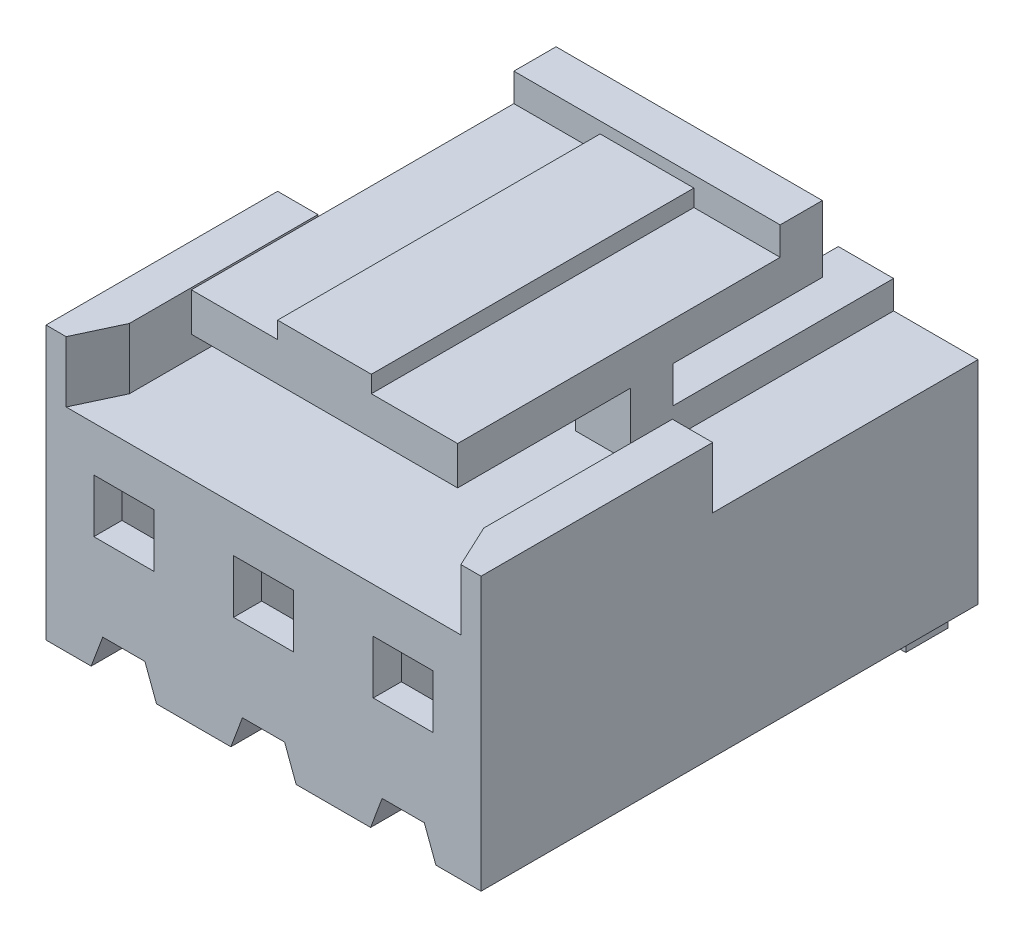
ISO-10303-21;
HEADER;
FILE_DESCRIPTION(('STEP AP214'),'2;1');
FILE_NAME('part.step','',(''),(''),'','','');
FILE_SCHEMA(('AUTOMOTIVE_DESIGN { 1 0 10303 214 1 1 1 1 }'));
ENDSEC;
DATA;
#1=APPLICATION_CONTEXT('core data for automotive mechanical design processes');
#2=APPLICATION_PROTOCOL_DEFINITION('international standard','automotive_design',2000,#1);
#3=PRODUCT_CONTEXT('',#1,'mechanical');
#4=PRODUCT('Part','Part','',(#3));
#5=PRODUCT_RELATED_PRODUCT_CATEGORY('part','',(#4));
#6=PRODUCT_DEFINITION_FORMATION('','',#4);
#7=PRODUCT_DEFINITION_CONTEXT('part definition',#1,'design');
#8=PRODUCT_DEFINITION('design','',#6,#7);
#9=PRODUCT_DEFINITION_SHAPE('','',#8);
#10=(LENGTH_UNIT() NAMED_UNIT(*) SI_UNIT(.MILLI.,.METRE.));
#11=(NAMED_UNIT(*) PLANE_ANGLE_UNIT() SI_UNIT($,.RADIAN.));
#12=(NAMED_UNIT(*) SI_UNIT($,.STERADIAN.) SOLID_ANGLE_UNIT());
#13=UNCERTAINTY_MEASURE_WITH_UNIT(LENGTH_MEASURE(1.E-05),#10,'distance_accuracy_value','');
#14=(GEOMETRIC_REPRESENTATION_CONTEXT(3) GLOBAL_UNCERTAINTY_ASSIGNED_CONTEXT((#13)) GLOBAL_UNIT_ASSIGNED_CONTEXT((#10,
#11,#12)) REPRESENTATION_CONTEXT('',''));
#15=CARTESIAN_POINT('',(0.,0.,0.));
#16=DIRECTION('',(0.,0.,1.));
#17=DIRECTION('',(1.,0.,0.));
#18=AXIS2_PLACEMENT_3D('',#15,#16,#17);
#19=CARTESIAN_POINT('',(1.2954,4.5212,-6.35));
#20=DIRECTION('',(-1.,0.,0.));
#21=DIRECTION('',(0.,0.,1.));
#22=AXIS2_PLACEMENT_3D('',#19,#20,#21);
#23=PLANE('',#22);
#24=DIRECTION('',(0.,-1.,0.));
#25=VECTOR('',#24,1.);
#26=CARTESIAN_POINT('',(1.2954,4.5212,-0.762000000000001));
#27=LINE('',#26,#25);
#28=CARTESIAN_POINT('',(1.2954,4.5212,-0.762000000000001));
#29=VERTEX_POINT('',#28);
#30=CARTESIAN_POINT('',(1.2954,3.0734,-0.762000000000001));
#31=VERTEX_POINT('',#30);
#32=EDGE_CURVE('E1123',#29,#31,#27,.T.);
#33=ORIENTED_EDGE('',*,*,#32,.F.);
#34=DIRECTION('',(0.,0.,1.));
#35=VECTOR('',#34,1.);
#36=CARTESIAN_POINT('',(1.2954,4.5212,-6.35));
#37=LINE('',#36,#35);
#38=CARTESIAN_POINT('',(1.2954,4.5212,0.));
#39=VERTEX_POINT('',#38);
#40=EDGE_CURVE('E978',#29,#39,#37,.T.);
#41=ORIENTED_EDGE('',*,*,#40,.T.);
#42=DIRECTION('',(0.,-1.,0.));
#43=VECTOR('',#42,1.);
#44=CARTESIAN_POINT('',(1.2954,4.5212,0.));
#45=LINE('',#44,#43);
#46=CARTESIAN_POINT('',(1.2954,3.0734,0.));
#47=VERTEX_POINT('',#46);
#48=EDGE_CURVE('E959',#39,#47,#45,.T.);
#49=ORIENTED_EDGE('',*,*,#48,.T.);
#50=DIRECTION('',(0.,0.,1.));
#51=VECTOR('',#50,1.);
#52=CARTESIAN_POINT('',(1.2954,3.0734,-6.35));
#53=LINE('',#52,#51);
#54=EDGE_CURVE('E977',#31,#47,#53,.T.);
#55=ORIENTED_EDGE('',*,*,#54,.F.);
#56=EDGE_LOOP('',(#33,#41,#49,#55));
#57=FACE_BOUND('',#56,.T.);
#58=ADVANCED_FACE('F30',(#57),#23,.F.);
#59=CARTESIAN_POINT('',(1.2954,4.5212,-6.35));
#60=DIRECTION('',(0.,1.,0.));
#61=DIRECTION('',(0.,0.,1.));
#62=AXIS2_PLACEMENT_3D('',#59,#60,#61);
#63=PLANE('',#62);
#64=DIRECTION('',(-1.,0.,0.));
#65=VECTOR('',#64,1.);
#66=CARTESIAN_POINT('',(1.2954,4.5212,-0.762000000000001));
#67=LINE('',#66,#65);
#68=CARTESIAN_POINT('',(2.921,4.5212,-0.762000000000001));
#69=VERTEX_POINT('',#68);
#70=EDGE_CURVE('E1121',#69,#29,#67,.T.);
#71=ORIENTED_EDGE('',*,*,#70,.F.);
#72=DIRECTION('',(0.,0.,1.));
#73=VECTOR('',#72,1.);
#74=CARTESIAN_POINT('',(2.921,4.5212,-6.35));
#75=LINE('',#74,#73);
#76=CARTESIAN_POINT('',(2.921,4.5212,0.));
#77=VERTEX_POINT('',#76);
#78=EDGE_CURVE('E981',#69,#77,#75,.T.);
#79=ORIENTED_EDGE('',*,*,#78,.T.);
#80=DIRECTION('',(-1.,0.,0.));
#81=VECTOR('',#80,1.);
#82=CARTESIAN_POINT('',(1.2954,4.5212,0.));
#83=LINE('',#82,#81);
#84=EDGE_CURVE('E974',#77,#39,#83,.T.);
#85=ORIENTED_EDGE('',*,*,#84,.T.);
#86=ORIENTED_EDGE('',*,*,#40,.F.);
#87=EDGE_LOOP('',(#71,#79,#85,#86));
#88=FACE_BOUND('',#87,.T.);
#89=ADVANCED_FACE('F1293',(#88),#63,.F.);
#90=CARTESIAN_POINT('',(2.921,4.5212,-6.35));
#91=DIRECTION('',(1.,0.,0.));
#92=DIRECTION('',(0.,0.,-1.));
#93=AXIS2_PLACEMENT_3D('',#90,#91,#92);
#94=PLANE('',#93);
#95=DIRECTION('',(0.,1.,0.));
#96=VECTOR('',#95,1.);
#97=CARTESIAN_POINT('',(2.921,4.5212,-0.762000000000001));
#98=LINE('',#97,#96);
#99=CARTESIAN_POINT('',(2.921,3.0734,-0.762000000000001));
#100=VERTEX_POINT('',#99);
#101=EDGE_CURVE('E1119',#100,#69,#98,.T.);
#102=ORIENTED_EDGE('',*,*,#101,.F.);
#103=DIRECTION('',(0.,0.,1.));
#104=VECTOR('',#103,1.);
#105=CARTESIAN_POINT('',(2.921,3.0734,-6.35));
#106=LINE('',#105,#104);
#107=CARTESIAN_POINT('',(2.921,3.0734,0.));
#108=VERTEX_POINT('',#107);
#109=EDGE_CURVE('E983',#100,#108,#106,.T.);
#110=ORIENTED_EDGE('',*,*,#109,.T.);
#111=DIRECTION('',(0.,1.,0.));
#112=VECTOR('',#111,1.);
#113=CARTESIAN_POINT('',(2.921,4.5212,0.));
#114=LINE('',#113,#112);
#115=EDGE_CURVE('E971',#108,#77,#114,.T.);
#116=ORIENTED_EDGE('',*,*,#115,.T.);
#117=ORIENTED_EDGE('',*,*,#78,.F.);
#118=EDGE_LOOP('',(#102,#110,#116,#117));
#119=FACE_BOUND('',#118,.T.);
#120=ADVANCED_FACE('F1299',(#119),#94,.F.);
#121=CARTESIAN_POINT('',(1.2954,3.0734,-6.35));
#122=DIRECTION('',(0.,-1.,0.));
#123=DIRECTION('',(0.,0.,-1.));
#124=AXIS2_PLACEMENT_3D('',#121,#122,#123);
#125=PLANE('',#124);
#126=DIRECTION('',(1.,0.,0.));
#127=VECTOR('',#126,1.);
#128=CARTESIAN_POINT('',(1.2954,3.0734,-0.762000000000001));
#129=LINE('',#128,#127);
#130=EDGE_CURVE('E1117',#31,#100,#129,.T.);
#131=ORIENTED_EDGE('',*,*,#130,.F.);
#132=ORIENTED_EDGE('',*,*,#54,.T.);
#133=DIRECTION('',(1.,0.,0.));
#134=VECTOR('',#133,1.);
#135=CARTESIAN_POINT('',(1.2954,3.0734,0.));
#136=LINE('',#135,#134);
#137=EDGE_CURVE('E968',#47,#108,#136,.T.);
#138=ORIENTED_EDGE('',*,*,#137,.T.);
#139=ORIENTED_EDGE('',*,*,#109,.F.);
#140=EDGE_LOOP('',(#131,#132,#138,#139));
#141=FACE_BOUND('',#140,.T.);
#142=ADVANCED_FACE('F1305',(#141),#125,.F.);
#143=CARTESIAN_POINT('',(1.53670007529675,0.8382,-6.35));
#144=DIRECTION('',(0.,1.,0.));
#145=DIRECTION('',(0.,0.,1.));
#146=AXIS2_PLACEMENT_3D('',#143,#144,#145);
#147=PLANE('',#146);
#148=DIRECTION('',(-1.,0.,0.));
#149=VECTOR('',#148,1.);
#150=CARTESIAN_POINT('',(1.53670007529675,0.8382,-0.762000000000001));
#151=LINE('',#150,#149);
#152=CARTESIAN_POINT('',(2.67970007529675,0.8382,-0.762000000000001));
#153=VERTEX_POINT('',#152);
#154=CARTESIAN_POINT('',(1.53670007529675,0.8382,-0.762000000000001));
#155=VERTEX_POINT('',#154);
#156=EDGE_CURVE('E1067',#153,#155,#151,.T.);
#157=ORIENTED_EDGE('',*,*,#156,.F.);
#158=DIRECTION('',(0.,0.,1.));
#159=VECTOR('',#158,1.);
#160=CARTESIAN_POINT('',(2.67970007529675,0.8382,-6.35));
#161=LINE('',#160,#159);
#162=CARTESIAN_POINT('',(2.67970007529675,0.8382,0.));
#163=VERTEX_POINT('',#162);
#164=EDGE_CURVE('E870',#153,#163,#161,.T.);
#165=ORIENTED_EDGE('',*,*,#164,.T.);
#166=DIRECTION('',(-1.,0.,0.));
#167=VECTOR('',#166,1.);
#168=CARTESIAN_POINT('',(1.53670007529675,0.8382,0.));
#169=LINE('',#168,#167);
#170=CARTESIAN_POINT('',(1.53670007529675,0.8382,0.));
#171=VERTEX_POINT('',#170);
#172=EDGE_CURVE('E1059',#163,#171,#169,.T.);
#173=ORIENTED_EDGE('',*,*,#172,.T.);
#174=DIRECTION('',(0.,0.,1.));
#175=VECTOR('',#174,1.);
#176=CARTESIAN_POINT('',(1.53670007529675,0.8382,-6.35));
#177=LINE('',#176,#175);
#178=EDGE_CURVE('E868',#155,#171,#177,.T.);
#179=ORIENTED_EDGE('',*,*,#178,.F.);
#180=EDGE_LOOP('',(#157,#165,#173,#179));
#181=FACE_BOUND('',#180,.T.);
#182=ADVANCED_FACE('F1065',(#181),#147,.F.);
#183=CARTESIAN_POINT('',(10.4902,4.5212,-6.35));
#184=DIRECTION('',(0.,1.,0.));
#185=DIRECTION('',(0.,0.,1.));
#186=AXIS2_PLACEMENT_3D('',#183,#184,#185);
#187=PLANE('',#186);
#188=DIRECTION('',(-1.,0.,0.));
#189=VECTOR('',#188,1.);
#190=CARTESIAN_POINT('',(10.4902,4.5212,-0.762000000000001));
#191=LINE('',#190,#189);
#192=CARTESIAN_POINT('',(10.4902,4.5212,-0.762000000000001));
#193=VERTEX_POINT('',#192);
#194=CARTESIAN_POINT('',(8.8646,4.5212,-0.762000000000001));
#195=VERTEX_POINT('',#194);
#196=EDGE_CURVE('E1174',#193,#195,#191,.T.);
#197=ORIENTED_EDGE('',*,*,#196,.F.);
#198=DIRECTION('',(0.,0.,1.));
#199=VECTOR('',#198,1.);
#200=CARTESIAN_POINT('',(10.4902,4.5212,-6.35));
#201=LINE('',#200,#199);
#202=CARTESIAN_POINT('',(10.4902,4.5212,0.));
#203=VERTEX_POINT('',#202);
#204=EDGE_CURVE('E912',#193,#203,#201,.T.);
#205=ORIENTED_EDGE('',*,*,#204,.T.);
#206=DIRECTION('',(-1.,0.,0.));
#207=VECTOR('',#206,1.);
#208=CARTESIAN_POINT('',(10.4902,4.5212,0.));
#209=LINE('',#208,#207);
#210=CARTESIAN_POINT('',(8.8646,4.5212,0.));
#211=VERTEX_POINT('',#210);
#212=EDGE_CURVE('E893',#203,#211,#209,.T.);
#213=ORIENTED_EDGE('',*,*,#212,.T.);
#214=DIRECTION('',(0.,0.,1.));
#215=VECTOR('',#214,1.);
#216=CARTESIAN_POINT('',(8.8646,4.5212,-6.35));
#217=LINE('',#216,#215);
#218=EDGE_CURVE('E911',#195,#211,#217,.T.);
#219=ORIENTED_EDGE('',*,*,#218,.F.);
#220=EDGE_LOOP('',(#197,#205,#213,#219));
#221=FACE_BOUND('',#220,.T.);
#222=ADVANCED_FACE('F1485',(#221),#187,.F.);
#223=CARTESIAN_POINT('',(10.4902,4.5212,-6.35));
#224=DIRECTION('',(1.,0.,0.));
#225=DIRECTION('',(0.,0.,-1.));
#226=AXIS2_PLACEMENT_3D('',#223,#224,#225);
#227=PLANE('',#226);
#228=DIRECTION('',(0.,1.,0.));
#229=VECTOR('',#228,1.);
#230=CARTESIAN_POINT('',(10.4902,4.5212,-0.762000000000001));
#231=LINE('',#230,#229);
#232=CARTESIAN_POINT('',(10.4902,3.0734,-0.762000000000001));
#233=VERTEX_POINT('',#232);
#234=EDGE_CURVE('E1172',#233,#193,#231,.T.);
#235=ORIENTED_EDGE('',*,*,#234,.F.);
#236=DIRECTION('',(0.,0.,1.));
#237=VECTOR('',#236,1.);
#238=CARTESIAN_POINT('',(10.4902,3.0734,-6.35));
#239=LINE('',#238,#237);
#240=CARTESIAN_POINT('',(10.4902,3.0734,0.));
#241=VERTEX_POINT('',#240);
#242=EDGE_CURVE('E915',#233,#241,#239,.T.);
#243=ORIENTED_EDGE('',*,*,#242,.T.);
#244=DIRECTION('',(0.,1.,0.));
#245=VECTOR('',#244,1.);
#246=CARTESIAN_POINT('',(10.4902,4.5212,0.));
#247=LINE('',#246,#245);
#248=EDGE_CURVE('E908',#241,#203,#247,.T.);
#249=ORIENTED_EDGE('',*,*,#248,.T.);
#250=ORIENTED_EDGE('',*,*,#204,.F.);
#251=EDGE_LOOP('',(#235,#243,#249,#250));
#252=FACE_BOUND('',#251,.T.);
#253=ADVANCED_FACE('F1496',(#252),#227,.F.);
#254=CARTESIAN_POINT('',(10.4902,3.0734,-6.35));
#255=DIRECTION('',(0.,-1.,0.));
#256=DIRECTION('',(1.,0.,0.));
#257=AXIS2_PLACEMENT_3D('',#254,#255,#256);
#258=PLANE('',#257);
#259=DIRECTION('',(1.,0.,0.));
#260=VECTOR('',#259,1.);
#261=CARTESIAN_POINT('',(10.4902,3.0734,-0.762000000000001));
#262=LINE('',#261,#260);
#263=CARTESIAN_POINT('',(8.8646,3.0734,-0.762000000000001));
#264=VERTEX_POINT('',#263);
#265=EDGE_CURVE('E1170',#264,#233,#262,.T.);
#266=ORIENTED_EDGE('',*,*,#265,.F.);
#267=DIRECTION('',(0.,0.,1.));
#268=VECTOR('',#267,1.);
#269=CARTESIAN_POINT('',(8.8646,3.0734,-6.35));
#270=LINE('',#269,#268);
#271=CARTESIAN_POINT('',(8.8646,3.0734,0.));
#272=VERTEX_POINT('',#271);
#273=EDGE_CURVE('E917',#264,#272,#270,.T.);
#274=ORIENTED_EDGE('',*,*,#273,.T.);
#275=DIRECTION('',(1.,0.,0.));
#276=VECTOR('',#275,1.);
#277=CARTESIAN_POINT('',(10.4902,3.0734,0.));
#278=LINE('',#277,#276);
#279=EDGE_CURVE('E905',#272,#241,#278,.T.);
#280=ORIENTED_EDGE('',*,*,#279,.T.);
#281=ORIENTED_EDGE('',*,*,#242,.F.);
#282=EDGE_LOOP('',(#266,#274,#280,#281));
#283=FACE_BOUND('',#282,.T.);
#284=ADVANCED_FACE('F1499',(#283),#258,.F.);
#285=CARTESIAN_POINT('',(8.8646,4.5212,-6.35));
#286=DIRECTION('',(-1.,0.,0.));
#287=DIRECTION('',(0.,0.,1.));
#288=AXIS2_PLACEMENT_3D('',#285,#286,#287);
#289=PLANE('',#288);
#290=DIRECTION('',(0.,-1.,0.));
#291=VECTOR('',#290,1.);
#292=CARTESIAN_POINT('',(8.8646,4.5212,-0.762000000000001));
#293=LINE('',#292,#291);
#294=EDGE_CURVE('E1168',#195,#264,#293,.T.);
#295=ORIENTED_EDGE('',*,*,#294,.F.);
#296=ORIENTED_EDGE('',*,*,#218,.T.);
#297=DIRECTION('',(0.,-1.,0.));
#298=VECTOR('',#297,1.);
#299=CARTESIAN_POINT('',(8.8646,4.5212,0.));
#300=LINE('',#299,#298);
#301=EDGE_CURVE('E902',#211,#272,#300,.T.);
#302=ORIENTED_EDGE('',*,*,#301,.T.);
#303=ORIENTED_EDGE('',*,*,#273,.F.);
#304=EDGE_LOOP('',(#295,#296,#302,#303));
#305=FACE_BOUND('',#304,.T.);
#306=ADVANCED_FACE('F1493',(#305),#289,.F.);
#307=CARTESIAN_POINT('',(10.2488999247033,0.838200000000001,-6.35));
#308=DIRECTION('',(0.,1.,0.));
#309=DIRECTION('',(-1.,0.,0.));
#310=AXIS2_PLACEMENT_3D('',#307,#308,#309);
#311=PLANE('',#310);
#312=DIRECTION('',(-1.,0.,0.));
#313=VECTOR('',#312,1.);
#314=CARTESIAN_POINT('',(10.2488999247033,0.838200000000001,-0.762000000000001));
#315=LINE('',#314,#313);
#316=CARTESIAN_POINT('',(10.2488999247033,0.838200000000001,-0.762000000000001));
#317=VERTEX_POINT('',#316);
#318=CARTESIAN_POINT('',(9.10589992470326,0.838200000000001,-0.762000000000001));
#319=VERTEX_POINT('',#318);
#320=EDGE_CURVE('E1034',#317,#319,#315,.T.);
#321=ORIENTED_EDGE('',*,*,#320,.F.);
#322=DIRECTION('',(0.,0.,1.));
#323=VECTOR('',#322,1.);
#324=CARTESIAN_POINT('',(10.2488999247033,0.838200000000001,-6.35));
#325=LINE('',#324,#323);
#326=CARTESIAN_POINT('',(10.2488999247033,0.838200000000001,0.));
#327=VERTEX_POINT('',#326);
#328=EDGE_CURVE('E885',#317,#327,#325,.T.);
#329=ORIENTED_EDGE('',*,*,#328,.T.);
#330=DIRECTION('',(-1.,0.,0.));
#331=VECTOR('',#330,1.);
#332=CARTESIAN_POINT('',(10.2488999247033,0.838200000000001,0.));
#333=LINE('',#332,#331);
#334=CARTESIAN_POINT('',(9.10589992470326,0.838200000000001,0.));
#335=VERTEX_POINT('',#334);
#336=EDGE_CURVE('E887',#327,#335,#333,.T.);
#337=ORIENTED_EDGE('',*,*,#336,.T.);
#338=DIRECTION('',(0.,0.,1.));
#339=VECTOR('',#338,1.);
#340=CARTESIAN_POINT('',(9.10589992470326,0.838200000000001,-6.35));
#341=LINE('',#340,#339);
#342=EDGE_CURVE('E897',#319,#335,#341,.T.);
#343=ORIENTED_EDGE('',*,*,#342,.F.);
#344=EDGE_LOOP('',(#321,#329,#337,#343));
#345=FACE_BOUND('',#344,.T.);
#346=ADVANCED_FACE('F1253',(#345),#311,.F.);
#347=CARTESIAN_POINT('',(5.3213,0.838200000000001,-6.35));
#348=DIRECTION('',(0.,1.,0.));
#349=DIRECTION('',(0.,0.,1.));
#350=AXIS2_PLACEMENT_3D('',#347,#348,#349);
#351=PLANE('',#350);
#352=DIRECTION('',(-1.,0.,0.));
#353=VECTOR('',#352,1.);
#354=CARTESIAN_POINT('',(5.3213,0.838200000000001,-0.762000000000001));
#355=LINE('',#354,#353);
#356=CARTESIAN_POINT('',(6.4643,0.838200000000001,-0.762000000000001));
#357=VERTEX_POINT('',#356);
#358=CARTESIAN_POINT('',(5.3213,0.838200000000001,-0.762000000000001));
#359=VERTEX_POINT('',#358);
#360=EDGE_CURVE('E1217',#357,#359,#355,.T.);
#361=ORIENTED_EDGE('',*,*,#360,.F.);
#362=DIRECTION('',(0.,0.,1.));
#363=VECTOR('',#362,1.);
#364=CARTESIAN_POINT('',(6.4643,0.838200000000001,-6.35));
#365=LINE('',#364,#363);
#366=CARTESIAN_POINT('',(6.4643,0.838200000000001,0.));
#367=VERTEX_POINT('',#366);
#368=EDGE_CURVE('E960',#357,#367,#365,.T.);
#369=ORIENTED_EDGE('',*,*,#368,.T.);
#370=DIRECTION('',(-1.,0.,0.));
#371=VECTOR('',#370,1.);
#372=CARTESIAN_POINT('',(5.3213,0.838200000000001,0.));
#373=LINE('',#372,#371);
#374=CARTESIAN_POINT('',(5.3213,0.838200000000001,0.));
#375=VERTEX_POINT('',#374);
#376=EDGE_CURVE('E943',#367,#375,#373,.T.);
#377=ORIENTED_EDGE('',*,*,#376,.T.);
#378=DIRECTION('',(0.,0.,1.));
#379=VECTOR('',#378,1.);
#380=CARTESIAN_POINT('',(5.3213,0.838200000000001,-6.35));
#381=LINE('',#380,#379);
#382=EDGE_CURVE('E957',#359,#375,#381,.T.);
#383=ORIENTED_EDGE('',*,*,#382,.F.);
#384=EDGE_LOOP('',(#361,#369,#377,#383));
#385=FACE_BOUND('',#384,.T.);
#386=ADVANCED_FACE('F1492',(#385),#351,.F.);
#387=CARTESIAN_POINT('',(5.08,4.5212,-6.35));
#388=DIRECTION('',(-1.,0.,0.));
#389=DIRECTION('',(0.,0.,1.));
#390=AXIS2_PLACEMENT_3D('',#387,#388,#389);
#391=PLANE('',#390);
#392=DIRECTION('',(0.,-1.,0.));
#393=VECTOR('',#392,1.);
#394=CARTESIAN_POINT('',(5.08,4.5212,-0.762000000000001));
#395=LINE('',#394,#393);
#396=CARTESIAN_POINT('',(5.08,4.5212,-0.762000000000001));
#397=VERTEX_POINT('',#396);
#398=CARTESIAN_POINT('',(5.08,3.0734,-0.762000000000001));
#399=VERTEX_POINT('',#398);
#400=EDGE_CURVE('E1213',#397,#399,#395,.T.);
#401=ORIENTED_EDGE('',*,*,#400,.F.);
#402=DIRECTION('',(0.,0.,1.));
#403=VECTOR('',#402,1.);
#404=CARTESIAN_POINT('',(5.08,4.5212,-6.35));
#405=LINE('',#404,#403);
#406=CARTESIAN_POINT('',(5.08,4.5212,0.));
#407=VERTEX_POINT('',#406);
#408=EDGE_CURVE('E932',#397,#407,#405,.T.);
#409=ORIENTED_EDGE('',*,*,#408,.T.);
#410=DIRECTION('',(0.,-1.,0.));
#411=VECTOR('',#410,1.);
#412=CARTESIAN_POINT('',(5.08,4.5212,0.));
#413=LINE('',#412,#411);
#414=CARTESIAN_POINT('',(5.08,3.0734,0.));
#415=VERTEX_POINT('',#414);
#416=EDGE_CURVE('E914',#407,#415,#413,.T.);
#417=ORIENTED_EDGE('',*,*,#416,.T.);
#418=DIRECTION('',(0.,0.,1.));
#419=VECTOR('',#418,1.);
#420=CARTESIAN_POINT('',(5.08,3.0734,-6.35));
#421=LINE('',#420,#419);
#422=EDGE_CURVE('E931',#399,#415,#421,.T.);
#423=ORIENTED_EDGE('',*,*,#422,.F.);
#424=EDGE_LOOP('',(#401,#409,#417,#423));
#425=FACE_BOUND('',#424,.T.);
#426=ADVANCED_FACE('F1514',(#425),#391,.F.);
#427=CARTESIAN_POINT('',(5.08,4.5212,-6.35));
#428=DIRECTION('',(0.,1.,0.));
#429=DIRECTION('',(0.,0.,1.));
#430=AXIS2_PLACEMENT_3D('',#427,#428,#429);
#431=PLANE('',#430);
#432=DIRECTION('',(-1.,0.,0.));
#433=VECTOR('',#432,1.);
#434=CARTESIAN_POINT('',(5.08,4.5212,-0.762000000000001));
#435=LINE('',#434,#433);
#436=CARTESIAN_POINT('',(6.7056,4.5212,-0.762000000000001));
#437=VERTEX_POINT('',#436);
#438=EDGE_CURVE('E1211',#437,#397,#435,.T.);
#439=ORIENTED_EDGE('',*,*,#438,.F.);
#440=DIRECTION('',(0.,0.,1.));
#441=VECTOR('',#440,1.);
#442=CARTESIAN_POINT('',(6.7056,4.5212,-6.35));
#443=LINE('',#442,#441);
#444=CARTESIAN_POINT('',(6.7056,4.5212,0.));
#445=VERTEX_POINT('',#444);
#446=EDGE_CURVE('E935',#437,#445,#443,.T.);
#447=ORIENTED_EDGE('',*,*,#446,.T.);
#448=DIRECTION('',(-1.,0.,0.));
#449=VECTOR('',#448,1.);
#450=CARTESIAN_POINT('',(5.08,4.5212,0.));
#451=LINE('',#450,#449);
#452=EDGE_CURVE('E928',#445,#407,#451,.T.);
#453=ORIENTED_EDGE('',*,*,#452,.T.);
#454=ORIENTED_EDGE('',*,*,#408,.F.);
#455=EDGE_LOOP('',(#439,#447,#453,#454));
#456=FACE_BOUND('',#455,.T.);
#457=ADVANCED_FACE('F1510',(#456),#431,.F.);
#458=CARTESIAN_POINT('',(6.7056,4.5212,-6.35));
#459=DIRECTION('',(1.,0.,0.));
#460=DIRECTION('',(0.,0.,-1.));
#461=AXIS2_PLACEMENT_3D('',#458,#459,#460);
#462=PLANE('',#461);
#463=DIRECTION('',(0.,1.,0.));
#464=VECTOR('',#463,1.);
#465=CARTESIAN_POINT('',(6.7056,4.5212,-0.762000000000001));
#466=LINE('',#465,#464);
#467=CARTESIAN_POINT('',(6.7056,3.0734,-0.762000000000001));
#468=VERTEX_POINT('',#467);
#469=EDGE_CURVE('E1203',#468,#437,#466,.T.);
#470=ORIENTED_EDGE('',*,*,#469,.F.);
#471=DIRECTION('',(0.,0.,1.));
#472=VECTOR('',#471,1.);
#473=CARTESIAN_POINT('',(6.7056,3.0734,-6.35));
#474=LINE('',#473,#472);
#475=CARTESIAN_POINT('',(6.7056,3.0734,0.));
#476=VERTEX_POINT('',#475);
#477=EDGE_CURVE('E937',#468,#476,#474,.T.);
#478=ORIENTED_EDGE('',*,*,#477,.T.);
#479=DIRECTION('',(0.,1.,0.));
#480=VECTOR('',#479,1.);
#481=CARTESIAN_POINT('',(6.7056,4.5212,0.));
#482=LINE('',#481,#480);
#483=EDGE_CURVE('E925',#476,#445,#482,.T.);
#484=ORIENTED_EDGE('',*,*,#483,.T.);
#485=ORIENTED_EDGE('',*,*,#446,.F.);
#486=EDGE_LOOP('',(#470,#478,#484,#485));
#487=FACE_BOUND('',#486,.T.);
#488=ADVANCED_FACE('F1513',(#487),#462,.F.);
#489=CARTESIAN_POINT('',(5.08,3.0734,-6.35));
#490=DIRECTION('',(0.,-1.,0.));
#491=DIRECTION('',(0.,0.,-1.));
#492=AXIS2_PLACEMENT_3D('',#489,#490,#491);
#493=PLANE('',#492);
#494=DIRECTION('',(1.,0.,0.));
#495=VECTOR('',#494,1.);
#496=CARTESIAN_POINT('',(5.08,3.0734,-0.762000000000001));
#497=LINE('',#496,#495);
#498=EDGE_CURVE('E1027',#399,#468,#497,.T.);
#499=ORIENTED_EDGE('',*,*,#498,.F.);
#500=ORIENTED_EDGE('',*,*,#422,.T.);
#501=DIRECTION('',(1.,0.,0.));
#502=VECTOR('',#501,1.);
#503=CARTESIAN_POINT('',(5.08,3.0734,0.));
#504=LINE('',#503,#502);
#505=EDGE_CURVE('E922',#415,#476,#504,.T.);
#506=ORIENTED_EDGE('',*,*,#505,.T.);
#507=ORIENTED_EDGE('',*,*,#477,.F.);
#508=EDGE_LOOP('',(#499,#500,#506,#507));
#509=FACE_BOUND('',#508,.T.);
#510=ADVANCED_FACE('F1333',(#509),#493,.F.);
#511=CARTESIAN_POINT('',(2.286,8.5344,-1.651));
#512=DIRECTION('',(0.,1.,0.));
#513=DIRECTION('',(0.,0.,1.));
#514=AXIS2_PLACEMENT_3D('',#511,#512,#513);
#515=PLANE('',#514);
#516=DIRECTION('',(0.,0.,1.));
#517=VECTOR('',#516,1.);
#518=CARTESIAN_POINT('',(4.6228,8.5344,-11.5316));
#519=LINE('',#518,#517);
#520=CARTESIAN_POINT('',(4.6228,8.5344,-10.3886));
#521=VERTEX_POINT('',#520);
#522=CARTESIAN_POINT('',(4.6228,8.5344,-1.651));
#523=VERTEX_POINT('',#522);
#524=EDGE_CURVE('E1011',#521,#523,#519,.T.);
#525=ORIENTED_EDGE('',*,*,#524,.F.);
#526=DIRECTION('',(1.,0.,0.));
#527=VECTOR('',#526,1.);
#528=CARTESIAN_POINT('',(2.286,8.5344,-10.3886));
#529=LINE('',#528,#527);
#530=CARTESIAN_POINT('',(2.286,8.5344,-10.3886));
#531=VERTEX_POINT('',#530);
#532=EDGE_CURVE('E990',#531,#521,#529,.T.);
#533=ORIENTED_EDGE('',*,*,#532,.F.);
#534=DIRECTION('',(0.,0.,1.));
#535=VECTOR('',#534,1.);
#536=CARTESIAN_POINT('',(2.286,8.5344,-11.5316));
#537=LINE('',#536,#535);
#538=CARTESIAN_POINT('',(2.286,8.5344,-1.651));
#539=VERTEX_POINT('',#538);
#540=EDGE_CURVE('E737',#531,#539,#537,.T.);
#541=ORIENTED_EDGE('',*,*,#540,.T.);
#542=DIRECTION('',(1.,0.,0.));
#543=VECTOR('',#542,1.);
#544=CARTESIAN_POINT('',(2.286,8.5344,-1.651));
#545=LINE('',#544,#543);
#546=EDGE_CURVE('E727',#539,#523,#545,.T.);
#547=ORIENTED_EDGE('',*,*,#546,.T.);
#548=EDGE_LOOP('',(#525,#533,#541,#547));
#549=FACE_BOUND('',#548,.T.);
#550=ADVANCED_FACE('F1330',(#549),#515,.T.);
#551=DIRECTION('',(0.,0.,-1.));
#552=VECTOR('',#551,1.);
#553=CARTESIAN_POINT('',(9.4996,8.5344,-11.5316));
#554=LINE('',#553,#552);
#555=CARTESIAN_POINT('',(9.4996,8.5344,-1.651));
#556=VERTEX_POINT('',#555);
#557=CARTESIAN_POINT('',(9.4996,8.5344,-10.3886));
#558=VERTEX_POINT('',#557);
#559=EDGE_CURVE('E731',#556,#558,#554,.T.);
#560=ORIENTED_EDGE('',*,*,#559,.T.);
#561=CARTESIAN_POINT('',(7.1628,8.5344,-10.3886));
#562=VERTEX_POINT('',#561);
#563=EDGE_CURVE('E980',#562,#558,#529,.T.);
#564=ORIENTED_EDGE('',*,*,#563,.F.);
#565=DIRECTION('',(0.,0.,-1.));
#566=VECTOR('',#565,1.);
#567=CARTESIAN_POINT('',(7.1628,8.5344,-11.5316));
#568=LINE('',#567,#566);
#569=CARTESIAN_POINT('',(7.1628,8.5344,-1.651));
#570=VERTEX_POINT('',#569);
#571=EDGE_CURVE('E1015',#570,#562,#568,.T.);
#572=ORIENTED_EDGE('',*,*,#571,.F.);
#573=EDGE_CURVE('E732',#570,#556,#545,.T.);
#574=ORIENTED_EDGE('',*,*,#573,.T.);
#575=EDGE_LOOP('',(#560,#564,#572,#574));
#576=FACE_BOUND('',#575,.T.);
#577=ADVANCED_FACE('F1328',(#576),#515,.T.);
#578=CARTESIAN_POINT('',(4.6228,8.9916,-11.5316));
#579=DIRECTION('',(1.,0.,0.));
#580=DIRECTION('',(0.,0.,-1.));
#581=AXIS2_PLACEMENT_3D('',#578,#579,#580);
#582=PLANE('',#581);
#583=DIRECTION('',(0.,1.,0.));
#584=VECTOR('',#583,1.);
#585=CARTESIAN_POINT('',(4.6228,8.9916,-10.3886));
#586=LINE('',#585,#584);
#587=CARTESIAN_POINT('',(4.6228,8.9916,-10.3886));
#588=VERTEX_POINT('',#587);
#589=EDGE_CURVE('E1008',#521,#588,#586,.T.);
#590=ORIENTED_EDGE('',*,*,#589,.F.);
#591=ORIENTED_EDGE('',*,*,#524,.T.);
#592=DIRECTION('',(0.,-1.,0.));
#593=VECTOR('',#592,1.);
#594=CARTESIAN_POINT('',(4.6228,8.9916,-1.651));
#595=LINE('',#594,#593);
#596=CARTESIAN_POINT('',(4.6228,8.9916,-1.651));
#597=VERTEX_POINT('',#596);
#598=EDGE_CURVE('E2168',#597,#523,#595,.T.);
#599=ORIENTED_EDGE('',*,*,#598,.F.);
#600=DIRECTION('',(0.,0.,1.));
#601=VECTOR('',#600,1.);
#602=CARTESIAN_POINT('',(4.6228,8.9916,-11.5316));
#603=LINE('',#602,#601);
#604=EDGE_CURVE('E1012',#588,#597,#603,.T.);
#605=ORIENTED_EDGE('',*,*,#604,.F.);
#606=EDGE_LOOP('',(#590,#591,#599,#605));
#607=FACE_BOUND('',#606,.T.);
#608=ADVANCED_FACE('F1324',(#607),#582,.F.);
#609=CARTESIAN_POINT('',(7.1628,8.9916,-11.5316));
#610=DIRECTION('',(-1.,0.,0.));
#611=DIRECTION('',(0.,0.,1.));
#612=AXIS2_PLACEMENT_3D('',#609,#610,#611);
#613=PLANE('',#612);
#614=DIRECTION('',(0.,-1.,0.));
#615=VECTOR('',#614,1.);
#616=CARTESIAN_POINT('',(7.1628,8.9916,-10.3886));
#617=LINE('',#616,#615);
#618=CARTESIAN_POINT('',(7.1628,8.9916,-10.3886));
#619=VERTEX_POINT('',#618);
#620=EDGE_CURVE('E1005',#619,#562,#617,.T.);
#621=ORIENTED_EDGE('',*,*,#620,.F.);
#622=DIRECTION('',(0.,0.,-1.));
#623=VECTOR('',#622,1.);
#624=CARTESIAN_POINT('',(7.1628,8.9916,-11.5316));
#625=LINE('',#624,#623);
#626=CARTESIAN_POINT('',(7.1628,8.9916,-1.651));
#627=VERTEX_POINT('',#626);
#628=EDGE_CURVE('E1017',#627,#619,#625,.T.);
#629=ORIENTED_EDGE('',*,*,#628,.F.);
#630=DIRECTION('',(0.,-1.,0.));
#631=VECTOR('',#630,1.);
#632=CARTESIAN_POINT('',(7.1628,8.9916,-1.651));
#633=LINE('',#632,#631);
#634=EDGE_CURVE('E1020',#627,#570,#633,.T.);
#635=ORIENTED_EDGE('',*,*,#634,.T.);
#636=ORIENTED_EDGE('',*,*,#571,.T.);
#637=EDGE_LOOP('',(#621,#629,#635,#636));
#638=FACE_BOUND('',#637,.T.);
#639=ADVANCED_FACE('F1320',(#638),#613,.F.);
#640=CARTESIAN_POINT('',(4.6228,8.9916,-1.651));
#641=DIRECTION('',(0.,1.,0.));
#642=DIRECTION('',(0.,0.,1.));
#643=AXIS2_PLACEMENT_3D('',#640,#641,#642);
#644=PLANE('',#643);
#645=ORIENTED_EDGE('',*,*,#628,.T.);
#646=DIRECTION('',(-1.,0.,0.));
#647=VECTOR('',#646,1.);
#648=CARTESIAN_POINT('',(4.6228,8.9916,-10.3886));
#649=LINE('',#648,#647);
#650=EDGE_CURVE('E586',#619,#588,#649,.T.);
#651=ORIENTED_EDGE('',*,*,#650,.T.);
#652=ORIENTED_EDGE('',*,*,#604,.T.);
#653=DIRECTION('',(1.,0.,0.));
#654=VECTOR('',#653,1.);
#655=CARTESIAN_POINT('',(4.6228,8.9916,-1.651));
#656=LINE('',#655,#654);
#657=EDGE_CURVE('E1014',#597,#627,#656,.T.);
#658=ORIENTED_EDGE('',*,*,#657,.T.);
#659=EDGE_LOOP('',(#645,#651,#652,#658));
#660=FACE_BOUND('',#659,.T.);
#661=ADVANCED_FACE('F1316',(#660),#644,.T.);
#662=CARTESIAN_POINT('',(8.001,6.5024,-6.33933750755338));
#663=DIRECTION('',(0.,1.,0.));
#664=DIRECTION('',(0.,0.,1.));
#665=AXIS2_PLACEMENT_3D('',#662,#663,#664);
#666=PLANE('',#665);
#667=DIRECTION('',(0.,0.,1.));
#668=VECTOR('',#667,1.);
#669=CARTESIAN_POINT('',(8.001,6.5024,-13.462));
#670=LINE('',#669,#668);
#671=CARTESIAN_POINT('',(8.001,6.5024,-13.462));
#672=VERTEX_POINT('',#671);
#673=CARTESIAN_POINT('',(8.001,6.5024,-7.48233750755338));
#674=VERTEX_POINT('',#673);
#675=EDGE_CURVE('E2134',#672,#674,#670,.T.);
#676=ORIENTED_EDGE('',*,*,#675,.T.);
#677=DIRECTION('',(-1.,0.,0.));
#678=VECTOR('',#677,1.);
#679=CARTESIAN_POINT('',(9.4996,6.5024,-7.48233750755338));
#680=LINE('',#679,#678);
#681=CARTESIAN_POINT('',(9.4996,6.5024,-7.48233750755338));
#682=VERTEX_POINT('',#681);
#683=EDGE_CURVE('E688',#682,#674,#680,.T.);
#684=ORIENTED_EDGE('',*,*,#683,.F.);
#685=DIRECTION('',(0.,0.,-1.));
#686=VECTOR('',#685,1.);
#687=CARTESIAN_POINT('',(9.4996,6.5024,-13.462));
#688=LINE('',#687,#686);
#689=CARTESIAN_POINT('',(9.4996,6.5024,-13.462));
#690=VERTEX_POINT('',#689);
#691=EDGE_CURVE('E2136',#682,#690,#688,.T.);
#692=ORIENTED_EDGE('',*,*,#691,.T.);
#693=DIRECTION('',(-1.,0.,0.));
#694=VECTOR('',#693,1.);
#695=CARTESIAN_POINT('',(8.001,6.5024,-13.462));
#696=LINE('',#695,#694);
#697=EDGE_CURVE('E2139',#690,#672,#696,.T.);
#698=ORIENTED_EDGE('',*,*,#697,.T.);
#699=EDGE_LOOP('',(#676,#684,#692,#698));
#700=FACE_BOUND('',#699,.T.);
#701=ADVANCED_FACE('F1319',(#700),#666,.T.);
#702=CARTESIAN_POINT('',(3.7846,6.5024,-6.33933750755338));
#703=DIRECTION('',(0.,-1.,0.));
#704=DIRECTION('',(0.,0.,-1.));
#705=AXIS2_PLACEMENT_3D('',#702,#703,#704);
#706=PLANE('',#705);
#707=DIRECTION('',(-1.,0.,0.));
#708=VECTOR('',#707,1.);
#709=CARTESIAN_POINT('',(2.286,6.5024,-7.48233750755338));
#710=LINE('',#709,#708);
#711=CARTESIAN_POINT('',(3.7846,6.5024,-7.48233750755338));
#712=VERTEX_POINT('',#711);
#713=CARTESIAN_POINT('',(2.286,6.5024,-7.48233750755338));
#714=VERTEX_POINT('',#713);
#715=EDGE_CURVE('E667',#712,#714,#710,.T.);
#716=ORIENTED_EDGE('',*,*,#715,.F.);
#717=DIRECTION('',(0.,0.,-1.));
#718=VECTOR('',#717,1.);
#719=CARTESIAN_POINT('',(3.7846,6.5024,-13.462));
#720=LINE('',#719,#718);
#721=CARTESIAN_POINT('',(3.7846,6.5024,-13.462));
#722=VERTEX_POINT('',#721);
#723=EDGE_CURVE('E2117',#712,#722,#720,.T.);
#724=ORIENTED_EDGE('',*,*,#723,.T.);
#725=DIRECTION('',(-1.,0.,0.));
#726=VECTOR('',#725,1.);
#727=CARTESIAN_POINT('',(3.7846,6.5024,-13.462));
#728=LINE('',#727,#726);
#729=CARTESIAN_POINT('',(2.286,6.5024,-13.462));
#730=VERTEX_POINT('',#729);
#731=EDGE_CURVE('E2119',#722,#730,#728,.T.);
#732=ORIENTED_EDGE('',*,*,#731,.T.);
#733=DIRECTION('',(0.,0.,1.));
#734=VECTOR('',#733,1.);
#735=CARTESIAN_POINT('',(2.286,6.5024,-13.462));
#736=LINE('',#735,#734);
#737=EDGE_CURVE('E2122',#730,#714,#736,.T.);
#738=ORIENTED_EDGE('',*,*,#737,.T.);
#739=EDGE_LOOP('',(#716,#724,#732,#738));
#740=FACE_BOUND('',#739,.T.);
#741=ADVANCED_FACE('F1351',(#740),#706,.F.);
#742=CARTESIAN_POINT('',(0.,5.7404,-13.462));
#743=DIRECTION('',(0.,-1.,0.));
#744=DIRECTION('',(0.,0.,-1.));
#745=AXIS2_PLACEMENT_3D('',#742,#743,#744);
#746=PLANE('',#745);
#747=DIRECTION('',(0.,0.,-1.));
#748=VECTOR('',#747,1.);
#749=CARTESIAN_POINT('',(3.7846,5.7404,-13.462));
#750=LINE('',#749,#748);
#751=CARTESIAN_POINT('',(3.7846,5.7404,-6.33933750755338));
#752=VERTEX_POINT('',#751);
#753=CARTESIAN_POINT('',(3.7846,5.7404,-13.462));
#754=VERTEX_POINT('',#753);
#755=EDGE_CURVE('E2112',#752,#754,#750,.T.);
#756=ORIENTED_EDGE('',*,*,#755,.F.);
#757=DIRECTION('',(1.,0.,0.));
#758=VECTOR('',#757,1.);
#759=CARTESIAN_POINT('',(3.7846,5.7404,-6.33933750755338));
#760=LINE('',#759,#758);
#761=CARTESIAN_POINT('',(2.286,5.7404,-6.33933750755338));
#762=VERTEX_POINT('',#761);
#763=EDGE_CURVE('E2120',#762,#752,#760,.T.);
#764=ORIENTED_EDGE('',*,*,#763,.F.);
#765=DIRECTION('',(0.,0.,1.));
#766=VECTOR('',#765,1.);
#767=CARTESIAN_POINT('',(2.286,5.7404,-13.462));
#768=LINE('',#767,#766);
#769=CARTESIAN_POINT('',(2.286,5.7404,-13.462));
#770=VERTEX_POINT('',#769);
#771=EDGE_CURVE('E2114',#770,#762,#768,.T.);
#772=ORIENTED_EDGE('',*,*,#771,.F.);
#773=DIRECTION('',(-1.,0.,0.));
#774=VECTOR('',#773,1.);
#775=CARTESIAN_POINT('',(0.,5.7404,-13.462));
#776=LINE('',#775,#774);
#777=CARTESIAN_POINT('',(0.,5.7404,-13.462));
#778=VERTEX_POINT('',#777);
#779=EDGE_CURVE('E590',#770,#778,#776,.T.);
#780=ORIENTED_EDGE('',*,*,#779,.T.);
#781=DIRECTION('',(0.,0.,1.));
#782=VECTOR('',#781,1.);
#783=CARTESIAN_POINT('',(0.,5.7404,0.));
#784=LINE('',#783,#782);
#785=CARTESIAN_POINT('',(0.,5.7404,-6.2738));
#786=VERTEX_POINT('',#785);
#787=EDGE_CURVE('E634',#778,#786,#784,.T.);
#788=ORIENTED_EDGE('',*,*,#787,.T.);
#789=DIRECTION('',(-1.,0.,0.));
#790=VECTOR('',#789,1.);
#791=CARTESIAN_POINT('',(0.,5.7404,-6.2738));
#792=LINE('',#791,#790);
#793=CARTESIAN_POINT('',(1.0922,5.7404,-6.2738));
#794=VERTEX_POINT('',#793);
#795=EDGE_CURVE('E808',#794,#786,#792,.T.);
#796=ORIENTED_EDGE('',*,*,#795,.F.);
#797=DIRECTION('',(0.,0.,-1.));
#798=VECTOR('',#797,1.);
#799=CARTESIAN_POINT('',(1.0922,5.7404,-6.2738));
#800=LINE('',#799,#798);
#801=CARTESIAN_POINT('',(1.0922,5.7404,-1.16634129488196));
#802=VERTEX_POINT('',#801);
#803=EDGE_CURVE('E799',#802,#794,#800,.T.);
#804=ORIENTED_EDGE('',*,*,#803,.F.);
#805=DIRECTION('',(0.424037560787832,0.,-0.905644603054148));
#806=VECTOR('',#805,1.);
#807=CARTESIAN_POINT('',(1.0922,5.7404,-1.16634129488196));
#808=LINE('',#807,#806);
#809=CARTESIAN_POINT('',(0.546100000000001,5.7404,0.));
#810=VERTEX_POINT('',#809);
#811=EDGE_CURVE('E796',#810,#802,#808,.T.);
#812=ORIENTED_EDGE('',*,*,#811,.F.);
#813=DIRECTION('',(1.,0.,0.));
#814=VECTOR('',#813,1.);
#815=CARTESIAN_POINT('',(0.,5.7404,0.));
#816=LINE('',#815,#814);
#817=CARTESIAN_POINT('',(11.2395,5.7404,0.));
#818=VERTEX_POINT('',#817);
#819=EDGE_CURVE('E591',#810,#818,#816,.T.);
#820=ORIENTED_EDGE('',*,*,#819,.T.);
#821=DIRECTION('',(0.424037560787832,0.,0.905644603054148));
#822=VECTOR('',#821,1.);
#823=CARTESIAN_POINT('',(10.6934,5.7404,-1.16634129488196));
#824=LINE('',#823,#822);
#825=CARTESIAN_POINT('',(10.6934,5.7404,-1.16634129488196));
#826=VERTEX_POINT('',#825);
#827=EDGE_CURVE('E652',#826,#818,#824,.T.);
#828=ORIENTED_EDGE('',*,*,#827,.F.);
#829=DIRECTION('',(0.,0.,1.));
#830=VECTOR('',#829,1.);
#831=CARTESIAN_POINT('',(10.6934,5.7404,-6.2738));
#832=LINE('',#831,#830);
#833=CARTESIAN_POINT('',(10.6934,5.7404,-6.2738));
#834=VERTEX_POINT('',#833);
#835=EDGE_CURVE('E649',#834,#826,#832,.T.);
#836=ORIENTED_EDGE('',*,*,#835,.F.);
#837=DIRECTION('',(-1.,0.,0.));
#838=VECTOR('',#837,1.);
#839=CARTESIAN_POINT('',(11.7856,5.7404,-6.2738));
#840=LINE('',#839,#838);
#841=CARTESIAN_POINT('',(11.7856,5.7404,-6.2738));
#842=VERTEX_POINT('',#841);
#843=EDGE_CURVE('E592',#842,#834,#840,.T.);
#844=ORIENTED_EDGE('',*,*,#843,.F.);
#845=DIRECTION('',(0.,0.,-1.));
#846=VECTOR('',#845,1.);
#847=CARTESIAN_POINT('',(11.7856,5.7404,0.));
#848=LINE('',#847,#846);
#849=CARTESIAN_POINT('',(11.7856,5.7404,-13.462));
#850=VERTEX_POINT('',#849);
#851=EDGE_CURVE('E587',#842,#850,#848,.T.);
#852=ORIENTED_EDGE('',*,*,#851,.T.);
#853=CARTESIAN_POINT('',(9.4996,5.7404,-13.462));
#854=VERTEX_POINT('',#853);
#855=EDGE_CURVE('E577',#850,#854,#776,.T.);
#856=ORIENTED_EDGE('',*,*,#855,.T.);
#857=DIRECTION('',(0.,0.,-1.));
#858=VECTOR('',#857,1.);
#859=CARTESIAN_POINT('',(9.4996,5.7404,-13.462));
#860=LINE('',#859,#858);
#861=CARTESIAN_POINT('',(9.4996,5.7404,-6.33933750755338));
#862=VERTEX_POINT('',#861);
#863=EDGE_CURVE('E2137',#862,#854,#860,.T.);
#864=ORIENTED_EDGE('',*,*,#863,.F.);
#865=DIRECTION('',(1.,0.,0.));
#866=VECTOR('',#865,1.);
#867=CARTESIAN_POINT('',(8.001,5.7404,-6.33933750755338));
#868=LINE('',#867,#866);
#869=CARTESIAN_POINT('',(8.001,5.7404,-6.33933750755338));
#870=VERTEX_POINT('',#869);
#871=EDGE_CURVE('E2143',#870,#862,#868,.T.);
#872=ORIENTED_EDGE('',*,*,#871,.F.);
#873=DIRECTION('',(0.,0.,1.));
#874=VECTOR('',#873,1.);
#875=CARTESIAN_POINT('',(8.001,5.7404,-13.462));
#876=LINE('',#875,#874);
#877=CARTESIAN_POINT('',(8.001,5.7404,-13.462));
#878=VERTEX_POINT('',#877);
#879=EDGE_CURVE('E795',#878,#870,#876,.T.);
#880=ORIENTED_EDGE('',*,*,#879,.F.);
#881=EDGE_CURVE('E600',#878,#754,#776,.T.);
#882=ORIENTED_EDGE('',*,*,#881,.T.);
#883=EDGE_LOOP('',(#756,#764,#772,#780,#788,#796,#804,#812,#820,#828,#836,#844,#852,#856,#864,
#872,#880,#882));
#884=FACE_BOUND('',#883,.T.);
#885=ADVANCED_FACE('F849',(#884),#746,.F.);
#886=CARTESIAN_POINT('',(0.,5.7404,0.));
#887=DIRECTION('',(1.,0.,0.));
#888=DIRECTION('',(0.,0.,-1.));
#889=AXIS2_PLACEMENT_3D('',#886,#887,#888);
#890=PLANE('',#889);
#891=DIRECTION('',(0.,0.,1.));
#892=VECTOR('',#891,1.);
#893=CARTESIAN_POINT('',(0.,0.,0.));
#894=LINE('',#893,#892);
#895=CARTESIAN_POINT('',(0.,0.,-13.462));
#896=VERTEX_POINT('',#895);
#897=CARTESIAN_POINT('',(0.,0.,0.));
#898=VERTEX_POINT('',#897);
#899=EDGE_CURVE('E601',#896,#898,#894,.T.);
#900=ORIENTED_EDGE('',*,*,#899,.T.);
#901=DIRECTION('',(0.,-1.,0.));
#902=VECTOR('',#901,1.);
#903=CARTESIAN_POINT('',(0.,5.7404,0.));
#904=LINE('',#903,#902);
#905=CARTESIAN_POINT('',(0.,7.3914,0.));
#906=VERTEX_POINT('',#905);
#907=EDGE_CURVE('E583',#906,#898,#904,.T.);
#908=ORIENTED_EDGE('',*,*,#907,.F.);
#909=DIRECTION('',(0.,0.,1.));
#910=VECTOR('',#909,1.);
#911=CARTESIAN_POINT('',(0.,7.3914,0.));
#912=LINE('',#911,#910);
#913=CARTESIAN_POINT('',(0.,7.3914,-6.2738));
#914=VERTEX_POINT('',#913);
#915=EDGE_CURVE('E812',#914,#906,#912,.T.);
#916=ORIENTED_EDGE('',*,*,#915,.F.);
#917=DIRECTION('',(0.,-1.,0.));
#918=VECTOR('',#917,1.);
#919=CARTESIAN_POINT('',(0.,7.3914,-6.2738));
#920=LINE('',#919,#918);
#921=EDGE_CURVE('E823',#914,#786,#920,.T.);
#922=ORIENTED_EDGE('',*,*,#921,.T.);
#923=ORIENTED_EDGE('',*,*,#787,.F.);
#924=DIRECTION('',(0.,-1.,0.));
#925=VECTOR('',#924,1.);
#926=CARTESIAN_POINT('',(0.,5.7404,-13.462));
#927=LINE('',#926,#925);
#928=EDGE_CURVE('E572',#778,#896,#927,.T.);
#929=ORIENTED_EDGE('',*,*,#928,.T.);
#930=EDGE_LOOP('',(#900,#908,#916,#922,#923,#929));
#931=FACE_BOUND('',#930,.T.);
#932=ADVANCED_FACE('F32',(#931),#890,.F.);
#933=CARTESIAN_POINT('',(0.,5.7404,0.));
#934=DIRECTION('',(0.,0.,-1.));
#935=DIRECTION('',(-1.,0.,0.));
#936=AXIS2_PLACEMENT_3D('',#933,#934,#935);
#937=PLANE('',#936);
#938=ORIENTED_EDGE('',*,*,#301,.F.);
#939=ORIENTED_EDGE('',*,*,#212,.F.);
#940=ORIENTED_EDGE('',*,*,#248,.F.);
#941=ORIENTED_EDGE('',*,*,#279,.F.);
#942=EDGE_LOOP('',(#938,#939,#940,#941));
#943=FACE_BOUND('',#942,.T.);
#944=ORIENTED_EDGE('',*,*,#505,.F.);
#945=ORIENTED_EDGE('',*,*,#416,.F.);
#946=ORIENTED_EDGE('',*,*,#452,.F.);
#947=ORIENTED_EDGE('',*,*,#483,.F.);
#948=EDGE_LOOP('',(#944,#945,#946,#947));
#949=FACE_BOUND('',#948,.T.);
#950=ORIENTED_EDGE('',*,*,#137,.F.);
#951=ORIENTED_EDGE('',*,*,#48,.F.);
#952=ORIENTED_EDGE('',*,*,#84,.F.);
#953=ORIENTED_EDGE('',*,*,#115,.F.);
#954=EDGE_LOOP('',(#950,#951,#952,#953));
#955=FACE_BOUND('',#954,.T.);
#956=ORIENTED_EDGE('',*,*,#172,.F.);
#957=DIRECTION('',(-0.349570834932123,0.93690993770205,0.));
#958=VECTOR('',#957,1.);
#959=CARTESIAN_POINT('',(2.67970007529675,0.8382,0.));
#960=LINE('',#959,#958);
#961=CARTESIAN_POINT('',(2.9924412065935,0.,0.));
#962=VERTEX_POINT('',#961);
#963=EDGE_CURVE('E1048',#962,#163,#960,.T.);
#964=ORIENTED_EDGE('',*,*,#963,.F.);
#965=DIRECTION('',(1.,0.,0.));
#966=VECTOR('',#965,1.);
#967=CARTESIAN_POINT('',(0.,0.,0.));
#968=LINE('',#967,#966);
#969=CARTESIAN_POINT('',(5.00855886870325,0.,0.));
#970=VERTEX_POINT('',#969);
#971=EDGE_CURVE('E607',#962,#970,#968,.T.);
#972=ORIENTED_EDGE('',*,*,#971,.T.);
#973=DIRECTION('',(-0.349570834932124,-0.936909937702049,0.));
#974=VECTOR('',#973,1.);
#975=CARTESIAN_POINT('',(5.3213,0.838200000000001,0.));
#976=LINE('',#975,#974);
#977=EDGE_CURVE('E934',#375,#970,#976,.T.);
#978=ORIENTED_EDGE('',*,*,#977,.F.);
#979=ORIENTED_EDGE('',*,*,#376,.F.);
#980=DIRECTION('',(-0.34957083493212,0.936909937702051,0.));
#981=VECTOR('',#980,1.);
#982=CARTESIAN_POINT('',(6.4643,0.838200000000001,0.));
#983=LINE('',#982,#981);
#984=CARTESIAN_POINT('',(6.77704113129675,0.,0.));
#985=VERTEX_POINT('',#984);
#986=EDGE_CURVE('E952',#985,#367,#983,.T.);
#987=ORIENTED_EDGE('',*,*,#986,.F.);
#988=CARTESIAN_POINT('',(8.79315879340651,0.,0.));
#989=VERTEX_POINT('',#988);
#990=EDGE_CURVE('E608',#985,#989,#968,.T.);
#991=ORIENTED_EDGE('',*,*,#990,.T.);
#992=DIRECTION('',(-0.349570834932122,-0.93690993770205,0.));
#993=VECTOR('',#992,1.);
#994=CARTESIAN_POINT('',(9.10589992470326,0.838200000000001,0.));
#995=LINE('',#994,#993);
#996=EDGE_CURVE('E880',#335,#989,#995,.T.);
#997=ORIENTED_EDGE('',*,*,#996,.F.);
#998=ORIENTED_EDGE('',*,*,#336,.F.);
#999=DIRECTION('',(-0.349570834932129,0.936909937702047,0.));
#1000=VECTOR('',#999,1.);
#1001=CARTESIAN_POINT('',(10.2488999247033,0.838200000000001,0.));
#1002=LINE('',#1001,#1000);
#1003=CARTESIAN_POINT('',(10.561641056,0.,0.));
#1004=VERTEX_POINT('',#1003);
#1005=EDGE_CURVE('E623',#1004,#327,#1002,.T.);
#1006=ORIENTED_EDGE('',*,*,#1005,.F.);
#1007=CARTESIAN_POINT('',(11.7856,0.,0.));
#1008=VERTEX_POINT('',#1007);
#1009=EDGE_CURVE('E603',#1004,#1008,#968,.T.);
#1010=ORIENTED_EDGE('',*,*,#1009,.T.);
#1011=DIRECTION('',(0.,-1.,0.));
#1012=VECTOR('',#1011,1.);
#1013=CARTESIAN_POINT('',(11.7856,5.7404,0.));
#1014=LINE('',#1013,#1012);
#1015=CARTESIAN_POINT('',(11.7856,7.3914,0.));
#1016=VERTEX_POINT('',#1015);
#1017=EDGE_CURVE('E580',#1016,#1008,#1014,.T.);
#1018=ORIENTED_EDGE('',*,*,#1017,.F.);
#1019=DIRECTION('',(1.,0.,0.));
#1020=VECTOR('',#1019,1.);
#1021=CARTESIAN_POINT('',(11.2395,7.3914,0.));
#1022=LINE('',#1021,#1020);
#1023=CARTESIAN_POINT('',(11.2395,7.3914,0.));
#1024=VERTEX_POINT('',#1023);
#1025=EDGE_CURVE('E656',#1024,#1016,#1022,.T.);
#1026=ORIENTED_EDGE('',*,*,#1025,.F.);
#1027=DIRECTION('',(0.,-1.,0.));
#1028=VECTOR('',#1027,1.);
#1029=CARTESIAN_POINT('',(11.2395,7.3914,0.));
#1030=LINE('',#1029,#1028);
#1031=EDGE_CURVE('E646',#1024,#818,#1030,.T.);
#1032=ORIENTED_EDGE('',*,*,#1031,.T.);
#1033=ORIENTED_EDGE('',*,*,#819,.F.);
#1034=DIRECTION('',(0.,-1.,0.));
#1035=VECTOR('',#1034,1.);
#1036=CARTESIAN_POINT('',(0.546100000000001,7.3914,0.));
#1037=LINE('',#1036,#1035);
#1038=CARTESIAN_POINT('',(0.546100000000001,7.3914,0.));
#1039=VERTEX_POINT('',#1038);
#1040=EDGE_CURVE('E816',#1039,#810,#1037,.T.);
#1041=ORIENTED_EDGE('',*,*,#1040,.F.);
#1042=DIRECTION('',(1.,0.,0.));
#1043=VECTOR('',#1042,1.);
#1044=CARTESIAN_POINT('',(0.546100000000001,7.3914,0.));
#1045=LINE('',#1044,#1043);
#1046=EDGE_CURVE('E815',#906,#1039,#1045,.T.);
#1047=ORIENTED_EDGE('',*,*,#1046,.F.);
#1048=ORIENTED_EDGE('',*,*,#907,.T.);
#1049=CARTESIAN_POINT('',(1.223958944,0.,0.));
#1050=VERTEX_POINT('',#1049);
#1051=EDGE_CURVE('E605',#898,#1050,#968,.T.);
#1052=ORIENTED_EDGE('',*,*,#1051,.T.);
#1053=DIRECTION('',(-0.349570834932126,-0.936909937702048,0.));
#1054=VECTOR('',#1053,1.);
#1055=CARTESIAN_POINT('',(1.53670007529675,0.8382,0.));
#1056=LINE('',#1055,#1054);
#1057=EDGE_CURVE('E1052',#171,#1050,#1056,.T.);
#1058=ORIENTED_EDGE('',*,*,#1057,.F.);
#1059=EDGE_LOOP('',(#956,#964,#972,#978,#979,#987,#991,#997,#998,#1006,#1010,#1018,#1026,#1032,
#1033,#1041,#1047,#1048,#1052,#1058));
#1060=FACE_BOUND('',#1059,.T.);
#1061=ADVANCED_FACE('F618',(#943,#949,#955,#1060),#937,.F.);
#1062=CARTESIAN_POINT('',(11.7856,5.7404,0.));
#1063=DIRECTION('',(-1.,0.,0.));
#1064=DIRECTION('',(0.,0.,1.));
#1065=AXIS2_PLACEMENT_3D('',#1062,#1063,#1064);
#1066=PLANE('',#1065);
#1067=DIRECTION('',(0.,0.,-1.));
#1068=VECTOR('',#1067,1.);
#1069=CARTESIAN_POINT('',(11.7856,0.,0.));
#1070=LINE('',#1069,#1068);
#1071=CARTESIAN_POINT('',(11.7856,0.,-13.462));
#1072=VERTEX_POINT('',#1071);
#1073=EDGE_CURVE('E567',#1008,#1072,#1070,.T.);
#1074=ORIENTED_EDGE('',*,*,#1073,.T.);
#1075=DIRECTION('',(0.,-1.,0.));
#1076=VECTOR('',#1075,1.);
#1077=CARTESIAN_POINT('',(11.7856,5.7404,-13.462));
#1078=LINE('',#1077,#1076);
#1079=EDGE_CURVE('E576',#850,#1072,#1078,.T.);
#1080=ORIENTED_EDGE('',*,*,#1079,.F.);
#1081=ORIENTED_EDGE('',*,*,#851,.F.);
#1082=DIRECTION('',(0.,-1.,0.));
#1083=VECTOR('',#1082,1.);
#1084=CARTESIAN_POINT('',(11.7856,7.3914,-6.2738));
#1085=LINE('',#1084,#1083);
#1086=CARTESIAN_POINT('',(11.7856,7.3914,-6.2738));
#1087=VERTEX_POINT('',#1086);
#1088=EDGE_CURVE('E604',#1087,#842,#1085,.T.);
#1089=ORIENTED_EDGE('',*,*,#1088,.F.);
#1090=DIRECTION('',(0.,0.,-1.));
#1091=VECTOR('',#1090,1.);
#1092=CARTESIAN_POINT('',(11.7856,7.3914,0.));
#1093=LINE('',#1092,#1091);
#1094=EDGE_CURVE('E630',#1016,#1087,#1093,.T.);
#1095=ORIENTED_EDGE('',*,*,#1094,.F.);
#1096=ORIENTED_EDGE('',*,*,#1017,.T.);
#1097=EDGE_LOOP('',(#1074,#1080,#1081,#1089,#1095,#1096));
#1098=FACE_BOUND('',#1097,.T.);
#1099=ADVANCED_FACE('F627',(#1098),#1066,.F.);
#1100=CARTESIAN_POINT('',(0.,5.7404,-13.462));
#1101=DIRECTION('',(0.,0.,1.));
#1102=DIRECTION('',(1.,0.,0.));
#1103=AXIS2_PLACEMENT_3D('',#1100,#1101,#1102);
#1104=PLANE('',#1103);
#1105=DIRECTION('',(0.,-1.,0.));
#1106=VECTOR('',#1105,1.);
#1107=CARTESIAN_POINT('',(3.7338,5.0292,-13.462));
#1108=LINE('',#1107,#1106);
#1109=CARTESIAN_POINT('',(3.7338,5.0292,-13.462));
#1110=VERTEX_POINT('',#1109);
#1111=CARTESIAN_POINT('',(3.7338,0.812799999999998,-13.462));
#1112=VERTEX_POINT('',#1111);
#1113=EDGE_CURVE('E551',#1110,#1112,#1108,.T.);
#1114=ORIENTED_EDGE('',*,*,#1113,.F.);
#1115=DIRECTION('',(1.,0.,0.));
#1116=VECTOR('',#1115,1.);
#1117=CARTESIAN_POINT('',(0.5334,5.0292,-13.462));
#1118=LINE('',#1117,#1116);
#1119=CARTESIAN_POINT('',(0.5334,5.0292,-13.462));
#1120=VERTEX_POINT('',#1119);
#1121=EDGE_CURVE('E549',#1120,#1110,#1118,.T.);
#1122=ORIENTED_EDGE('',*,*,#1121,.F.);
#1123=DIRECTION('',(0.,1.,0.));
#1124=VECTOR('',#1123,1.);
#1125=CARTESIAN_POINT('',(0.5334,5.0292,-13.462));
#1126=LINE('',#1125,#1124);
#1127=CARTESIAN_POINT('',(0.5334,0.812799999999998,-13.462));
#1128=VERTEX_POINT('',#1127);
#1129=EDGE_CURVE('E1101',#1128,#1120,#1126,.T.);
#1130=ORIENTED_EDGE('',*,*,#1129,.F.);
#1131=DIRECTION('',(-1.,0.,0.));
#1132=VECTOR('',#1131,1.);
#1133=CARTESIAN_POINT('',(0.5334,0.812799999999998,-13.462));
#1134=LINE('',#1133,#1132);
#1135=EDGE_CURVE('E1099',#1112,#1128,#1134,.T.);
#1136=ORIENTED_EDGE('',*,*,#1135,.F.);
#1137=EDGE_LOOP('',(#1114,#1122,#1130,#1136));
#1138=FACE_BOUND('',#1137,.T.);
#1139=DIRECTION('',(-1.,0.,0.));
#1140=VECTOR('',#1139,1.);
#1141=CARTESIAN_POINT('',(11.2522,0.812799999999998,-13.462));
#1142=LINE('',#1141,#1140);
#1143=CARTESIAN_POINT('',(11.2522,0.812799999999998,-13.462));
#1144=VERTEX_POINT('',#1143);
#1145=CARTESIAN_POINT('',(8.0518,0.812799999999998,-13.462));
#1146=VERTEX_POINT('',#1145);
#1147=EDGE_CURVE('E1142',#1144,#1146,#1142,.T.);
#1148=ORIENTED_EDGE('',*,*,#1147,.F.);
#1149=DIRECTION('',(0.,-1.,0.));
#1150=VECTOR('',#1149,1.);
#1151=CARTESIAN_POINT('',(11.2522,5.0292,-13.462));
#1152=LINE('',#1151,#1150);
#1153=CARTESIAN_POINT('',(11.2522,5.0292,-13.462));
#1154=VERTEX_POINT('',#1153);
#1155=EDGE_CURVE('E1125',#1154,#1144,#1152,.T.);
#1156=ORIENTED_EDGE('',*,*,#1155,.F.);
#1157=DIRECTION('',(1.,0.,0.));
#1158=VECTOR('',#1157,1.);
#1159=CARTESIAN_POINT('',(11.2522,5.0292,-13.462));
#1160=LINE('',#1159,#1158);
#1161=CARTESIAN_POINT('',(8.0518,5.0292,-13.462));
#1162=VERTEX_POINT('',#1161);
#1163=EDGE_CURVE('E1130',#1162,#1154,#1160,.T.);
#1164=ORIENTED_EDGE('',*,*,#1163,.F.);
#1165=DIRECTION('',(0.,1.,0.));
#1166=VECTOR('',#1165,1.);
#1167=CARTESIAN_POINT('',(8.0518,5.0292,-13.462));
#1168=LINE('',#1167,#1166);
#1169=EDGE_CURVE('E1145',#1146,#1162,#1168,.T.);
#1170=ORIENTED_EDGE('',*,*,#1169,.F.);
#1171=EDGE_LOOP('',(#1148,#1156,#1164,#1170));
#1172=FACE_BOUND('',#1171,.T.);
#1173=DIRECTION('',(-1.,0.,0.));
#1174=VECTOR('',#1173,1.);
#1175=CARTESIAN_POINT('',(7.493,0.812799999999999,-13.462));
#1176=LINE('',#1175,#1174);
#1177=CARTESIAN_POINT('',(7.493,0.812799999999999,-13.462));
#1178=VERTEX_POINT('',#1177);
#1179=CARTESIAN_POINT('',(4.2926,0.812799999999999,-13.462));
#1180=VERTEX_POINT('',#1179);
#1181=EDGE_CURVE('E1193',#1178,#1180,#1176,.T.);
#1182=ORIENTED_EDGE('',*,*,#1181,.F.);
#1183=DIRECTION('',(0.,-1.,0.));
#1184=VECTOR('',#1183,1.);
#1185=CARTESIAN_POINT('',(7.493,5.0292,-13.462));
#1186=LINE('',#1185,#1184);
#1187=CARTESIAN_POINT('',(7.493,5.0292,-13.462));
#1188=VERTEX_POINT('',#1187);
#1189=EDGE_CURVE('E1176',#1188,#1178,#1186,.T.);
#1190=ORIENTED_EDGE('',*,*,#1189,.F.);
#1191=DIRECTION('',(1.,0.,0.));
#1192=VECTOR('',#1191,1.);
#1193=CARTESIAN_POINT('',(7.493,5.0292,-13.462));
#1194=LINE('',#1193,#1192);
#1195=CARTESIAN_POINT('',(4.2926,5.0292,-13.462));
#1196=VERTEX_POINT('',#1195);
#1197=EDGE_CURVE('E1181',#1196,#1188,#1194,.T.);
#1198=ORIENTED_EDGE('',*,*,#1197,.F.);
#1199=DIRECTION('',(0.,1.,0.));
#1200=VECTOR('',#1199,1.);
#1201=CARTESIAN_POINT('',(4.2926,5.0292,-13.462));
#1202=LINE('',#1201,#1200);
#1203=EDGE_CURVE('E1196',#1180,#1196,#1202,.T.);
#1204=ORIENTED_EDGE('',*,*,#1203,.F.);
#1205=EDGE_LOOP('',(#1182,#1190,#1198,#1204));
#1206=FACE_BOUND('',#1205,.T.);
#1207=DIRECTION('',(-1.,0.,0.));
#1208=VECTOR('',#1207,1.);
#1209=CARTESIAN_POINT('',(0.,0.,-13.462));
#1210=LINE('',#1209,#1208);
#1211=CARTESIAN_POINT('',(10.9728,0.,-13.462));
#1212=VERTEX_POINT('',#1211);
#1213=EDGE_CURVE('E566',#1072,#1212,#1210,.T.);
#1214=ORIENTED_EDGE('',*,*,#1213,.T.);
#1215=DIRECTION('',(0.,1.,0.));
#1216=VECTOR('',#1215,1.);
#1217=CARTESIAN_POINT('',(10.9728,-0.9652,-13.462));
#1218=LINE('',#1217,#1216);
#1219=CARTESIAN_POINT('',(10.9728,-0.9652,-13.462));
#1220=VERTEX_POINT('',#1219);
#1221=EDGE_CURVE('E533',#1220,#1212,#1218,.T.);
#1222=ORIENTED_EDGE('',*,*,#1221,.F.);
#1223=DIRECTION('',(1.,0.,0.));
#1224=VECTOR('',#1223,1.);
#1225=CARTESIAN_POINT('',(0.812800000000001,-0.9652,-13.462));
#1226=LINE('',#1225,#1224);
#1227=CARTESIAN_POINT('',(0.812800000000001,-0.9652,-13.462));
#1228=VERTEX_POINT('',#1227);
#1229=EDGE_CURVE('E526',#1228,#1220,#1226,.T.);
#1230=ORIENTED_EDGE('',*,*,#1229,.F.);
#1231=DIRECTION('',(0.,1.,0.));
#1232=VECTOR('',#1231,1.);
#1233=CARTESIAN_POINT('',(0.812800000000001,-0.9652,-13.462));
#1234=LINE('',#1233,#1232);
#1235=CARTESIAN_POINT('',(0.8128,0.,-13.462));
#1236=VERTEX_POINT('',#1235);
#1237=EDGE_CURVE('E531',#1228,#1236,#1234,.T.);
#1238=ORIENTED_EDGE('',*,*,#1237,.T.);
#1239=EDGE_CURVE('E52',#1236,#896,#1210,.T.);
#1240=ORIENTED_EDGE('',*,*,#1239,.T.);
#1241=ORIENTED_EDGE('',*,*,#928,.F.);
#1242=ORIENTED_EDGE('',*,*,#779,.F.);
#1243=DIRECTION('',(0.,-1.,0.));
#1244=VECTOR('',#1243,1.);
#1245=CARTESIAN_POINT('',(2.286,6.5024,-13.462));
#1246=LINE('',#1245,#1244);
#1247=EDGE_CURVE('E719',#730,#770,#1246,.T.);
#1248=ORIENTED_EDGE('',*,*,#1247,.F.);
#1249=ORIENTED_EDGE('',*,*,#731,.F.);
#1250=DIRECTION('',(0.,-1.,0.));
#1251=VECTOR('',#1250,1.);
#1252=CARTESIAN_POINT('',(3.7846,6.5024,-13.462));
#1253=LINE('',#1252,#1251);
#1254=EDGE_CURVE('E2131',#722,#754,#1253,.T.);
#1255=ORIENTED_EDGE('',*,*,#1254,.T.);
#1256=ORIENTED_EDGE('',*,*,#881,.F.);
#1257=DIRECTION('',(0.,-1.,0.));
#1258=VECTOR('',#1257,1.);
#1259=CARTESIAN_POINT('',(8.001,6.5024,-13.462));
#1260=LINE('',#1259,#1258);
#1261=EDGE_CURVE('E2141',#672,#878,#1260,.T.);
#1262=ORIENTED_EDGE('',*,*,#1261,.F.);
#1263=ORIENTED_EDGE('',*,*,#697,.F.);
#1264=DIRECTION('',(0.,-1.,0.));
#1265=VECTOR('',#1264,1.);
#1266=CARTESIAN_POINT('',(9.4996,6.5024,-13.462));
#1267=LINE('',#1266,#1265);
#1268=EDGE_CURVE('E682',#690,#854,#1267,.T.);
#1269=ORIENTED_EDGE('',*,*,#1268,.T.);
#1270=ORIENTED_EDGE('',*,*,#855,.F.);
#1271=ORIENTED_EDGE('',*,*,#1079,.T.);
#1272=EDGE_LOOP('',(#1214,#1222,#1230,#1238,#1240,#1241,#1242,#1248,#1249,#1255,#1256,#1262,
#1263,#1269,#1270,#1271));
#1273=FACE_BOUND('',#1272,.T.);
#1274=ADVANCED_FACE('F529',(#1138,#1172,#1206,#1273),#1104,.F.);
#1275=CARTESIAN_POINT('',(0.,0.,-13.462));
#1276=DIRECTION('',(0.,-1.,0.));
#1277=DIRECTION('',(0.,0.,-1.));
#1278=AXIS2_PLACEMENT_3D('',#1275,#1276,#1277);
#1279=PLANE('',#1278);
#1280=DIRECTION('',(0.,0.,-1.));
#1281=VECTOR('',#1280,1.);
#1282=CARTESIAN_POINT('',(0.812800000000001,0.,-13.462));
#1283=LINE('',#1282,#1281);
#1284=CARTESIAN_POINT('',(0.8128,0.,-12.319));
#1285=VERTEX_POINT('',#1284);
#1286=EDGE_CURVE('E34',#1285,#1236,#1283,.T.);
#1287=ORIENTED_EDGE('',*,*,#1286,.F.);
#1288=DIRECTION('',(-1.,0.,0.));
#1289=VECTOR('',#1288,1.);
#1290=CARTESIAN_POINT('',(0.8128,0.,-12.319));
#1291=LINE('',#1290,#1289);
#1292=CARTESIAN_POINT('',(10.9728,0.,-12.319));
#1293=VERTEX_POINT('',#1292);
#1294=EDGE_CURVE('E546',#1293,#1285,#1291,.T.);
#1295=ORIENTED_EDGE('',*,*,#1294,.F.);
#1296=DIRECTION('',(0.,0.,1.));
#1297=VECTOR('',#1296,1.);
#1298=CARTESIAN_POINT('',(10.9728,0.,-13.462));
#1299=LINE('',#1298,#1297);
#1300=EDGE_CURVE('E561',#1212,#1293,#1299,.T.);
#1301=ORIENTED_EDGE('',*,*,#1300,.F.);
#1302=ORIENTED_EDGE('',*,*,#1213,.F.);
#1303=ORIENTED_EDGE('',*,*,#1073,.F.);
#1304=ORIENTED_EDGE('',*,*,#1009,.F.);
#1305=DIRECTION('',(0.,0.,1.));
#1306=VECTOR('',#1305,1.);
#1307=CARTESIAN_POINT('',(10.561641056,0.,-6.35));
#1308=LINE('',#1307,#1306);
#1309=CARTESIAN_POINT('',(10.561641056,0.,-6.35));
#1310=VERTEX_POINT('',#1309);
#1311=EDGE_CURVE('E891',#1310,#1004,#1308,.T.);
#1312=ORIENTED_EDGE('',*,*,#1311,.F.);
#1313=DIRECTION('',(1.,0.,0.));
#1314=VECTOR('',#1313,1.);
#1315=CARTESIAN_POINT('',(10.561641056,0.,-6.35));
#1316=LINE('',#1315,#1314);
#1317=CARTESIAN_POINT('',(8.79315879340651,0.,-6.35));
#1318=VERTEX_POINT('',#1317);
#1319=EDGE_CURVE('E882',#1318,#1310,#1316,.T.);
#1320=ORIENTED_EDGE('',*,*,#1319,.F.);
#1321=DIRECTION('',(0.,0.,1.));
#1322=VECTOR('',#1321,1.);
#1323=CARTESIAN_POINT('',(8.79315879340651,0.,-6.35));
#1324=LINE('',#1323,#1322);
#1325=EDGE_CURVE('E894',#1318,#989,#1324,.T.);
#1326=ORIENTED_EDGE('',*,*,#1325,.T.);
#1327=ORIENTED_EDGE('',*,*,#990,.F.);
#1328=DIRECTION('',(0.,0.,1.));
#1329=VECTOR('',#1328,1.);
#1330=CARTESIAN_POINT('',(6.77704113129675,0.,-6.35));
#1331=LINE('',#1330,#1329);
#1332=CARTESIAN_POINT('',(6.77704113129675,0.,-6.35));
#1333=VERTEX_POINT('',#1332);
#1334=EDGE_CURVE('E962',#1333,#985,#1331,.T.);
#1335=ORIENTED_EDGE('',*,*,#1334,.F.);
#1336=DIRECTION('',(1.,0.,0.));
#1337=VECTOR('',#1336,1.);
#1338=CARTESIAN_POINT('',(5.00855886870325,0.,-6.35));
#1339=LINE('',#1338,#1337);
#1340=CARTESIAN_POINT('',(5.00855886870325,0.,-6.35));
#1341=VERTEX_POINT('',#1340);
#1342=EDGE_CURVE('E942',#1341,#1333,#1339,.T.);
#1343=ORIENTED_EDGE('',*,*,#1342,.F.);
#1344=DIRECTION('',(0.,0.,1.));
#1345=VECTOR('',#1344,1.);
#1346=CARTESIAN_POINT('',(5.00855886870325,0.,-6.35));
#1347=LINE('',#1346,#1345);
#1348=EDGE_CURVE('E949',#1341,#970,#1347,.T.);
#1349=ORIENTED_EDGE('',*,*,#1348,.T.);
#1350=ORIENTED_EDGE('',*,*,#971,.F.);
#1351=DIRECTION('',(0.,0.,1.));
#1352=VECTOR('',#1351,1.);
#1353=CARTESIAN_POINT('',(2.9924412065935,0.,-6.35));
#1354=LINE('',#1353,#1352);
#1355=CARTESIAN_POINT('',(2.9924412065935,0.,-6.35));
#1356=VERTEX_POINT('',#1355);
#1357=EDGE_CURVE('E867',#1356,#962,#1354,.T.);
#1358=ORIENTED_EDGE('',*,*,#1357,.F.);
#1359=DIRECTION('',(1.,0.,0.));
#1360=VECTOR('',#1359,1.);
#1361=CARTESIAN_POINT('',(1.223958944,0.,-6.35));
#1362=LINE('',#1361,#1360);
#1363=CARTESIAN_POINT('',(1.223958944,0.,-6.35));
#1364=VERTEX_POINT('',#1363);
#1365=EDGE_CURVE('E864',#1364,#1356,#1362,.T.);
#1366=ORIENTED_EDGE('',*,*,#1365,.F.);
#1367=DIRECTION('',(0.,0.,1.));
#1368=VECTOR('',#1367,1.);
#1369=CARTESIAN_POINT('',(1.223958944,0.,-6.35));
#1370=LINE('',#1369,#1368);
#1371=EDGE_CURVE('E862',#1364,#1050,#1370,.T.);
#1372=ORIENTED_EDGE('',*,*,#1371,.T.);
#1373=ORIENTED_EDGE('',*,*,#1051,.F.);
#1374=ORIENTED_EDGE('',*,*,#899,.F.);
#1375=ORIENTED_EDGE('',*,*,#1239,.F.);
#1376=EDGE_LOOP('',(#1287,#1295,#1301,#1302,#1303,#1304,#1312,#1320,#1326,#1327,#1335,#1343,
#1349,#1350,#1358,#1366,#1372,#1373,#1374,#1375));
#1377=FACE_BOUND('',#1376,.T.);
#1378=ADVANCED_FACE('F633',(#1377),#1279,.T.);
#1379=CARTESIAN_POINT('',(11.7856,7.3914,-6.2738));
#1380=DIRECTION('',(0.,0.,1.));
#1381=DIRECTION('',(1.,0.,0.));
#1382=AXIS2_PLACEMENT_3D('',#1379,#1380,#1381);
#1383=PLANE('',#1382);
#1384=ORIENTED_EDGE('',*,*,#843,.T.);
#1385=DIRECTION('',(0.,-1.,0.));
#1386=VECTOR('',#1385,1.);
#1387=CARTESIAN_POINT('',(10.6934,7.3914,-6.2738));
#1388=LINE('',#1387,#1386);
#1389=CARTESIAN_POINT('',(10.6934,7.3914,-6.2738));
#1390=VERTEX_POINT('',#1389);
#1391=EDGE_CURVE('E640',#1390,#834,#1388,.T.);
#1392=ORIENTED_EDGE('',*,*,#1391,.F.);
#1393=DIRECTION('',(-1.,0.,0.));
#1394=VECTOR('',#1393,1.);
#1395=CARTESIAN_POINT('',(11.7856,7.3914,-6.2738));
#1396=LINE('',#1395,#1394);
#1397=EDGE_CURVE('E834',#1087,#1390,#1396,.T.);
#1398=ORIENTED_EDGE('',*,*,#1397,.F.);
#1399=ORIENTED_EDGE('',*,*,#1088,.T.);
#1400=EDGE_LOOP('',(#1384,#1392,#1398,#1399));
#1401=FACE_BOUND('',#1400,.T.);
#1402=ADVANCED_FACE('F1394',(#1401),#1383,.F.);
#1403=CARTESIAN_POINT('',(10.6934,7.3914,-6.2738));
#1404=DIRECTION('',(1.,0.,0.));
#1405=DIRECTION('',(0.,0.,-1.));
#1406=AXIS2_PLACEMENT_3D('',#1403,#1404,#1405);
#1407=PLANE('',#1406);
#1408=ORIENTED_EDGE('',*,*,#835,.T.);
#1409=DIRECTION('',(0.,-1.,0.));
#1410=VECTOR('',#1409,1.);
#1411=CARTESIAN_POINT('',(10.6934,7.3914,-1.16634129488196));
#1412=LINE('',#1411,#1410);
#1413=CARTESIAN_POINT('',(10.6934,7.3914,-1.16634129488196));
#1414=VERTEX_POINT('',#1413);
#1415=EDGE_CURVE('E643',#1414,#826,#1412,.T.);
#1416=ORIENTED_EDGE('',*,*,#1415,.F.);
#1417=DIRECTION('',(0.,0.,1.));
#1418=VECTOR('',#1417,1.);
#1419=CARTESIAN_POINT('',(10.6934,7.3914,-6.2738));
#1420=LINE('',#1419,#1418);
#1421=EDGE_CURVE('E836',#1390,#1414,#1420,.T.);
#1422=ORIENTED_EDGE('',*,*,#1421,.F.);
#1423=ORIENTED_EDGE('',*,*,#1391,.T.);
#1424=EDGE_LOOP('',(#1408,#1416,#1422,#1423));
#1425=FACE_BOUND('',#1424,.T.);
#1426=ADVANCED_FACE('F1391',(#1425),#1407,.F.);
#1427=CARTESIAN_POINT('',(10.6934,7.3914,-1.16634129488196));
#1428=DIRECTION('',(0.905644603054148,0.,-0.424037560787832));
#1429=DIRECTION('',(-0.424037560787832,0.,-0.905644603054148));
#1430=AXIS2_PLACEMENT_3D('',#1427,#1428,#1429);
#1431=PLANE('',#1430);
#1432=ORIENTED_EDGE('',*,*,#827,.T.);
#1433=ORIENTED_EDGE('',*,*,#1031,.F.);
#1434=DIRECTION('',(0.424037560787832,0.,0.905644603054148));
#1435=VECTOR('',#1434,1.);
#1436=CARTESIAN_POINT('',(10.6934,7.3914,-1.16634129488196));
#1437=LINE('',#1436,#1435);
#1438=EDGE_CURVE('E661',#1414,#1024,#1437,.T.);
#1439=ORIENTED_EDGE('',*,*,#1438,.F.);
#1440=ORIENTED_EDGE('',*,*,#1415,.T.);
#1441=EDGE_LOOP('',(#1432,#1433,#1439,#1440));
#1442=FACE_BOUND('',#1441,.T.);
#1443=ADVANCED_FACE('F844',(#1442),#1431,.F.);
#1444=CARTESIAN_POINT('',(11.7856,7.3914,0.));
#1445=DIRECTION('',(0.,1.,0.));
#1446=DIRECTION('',(0.,0.,1.));
#1447=AXIS2_PLACEMENT_3D('',#1444,#1445,#1446);
#1448=PLANE('',#1447);
#1449=ORIENTED_EDGE('',*,*,#1025,.T.);
#1450=ORIENTED_EDGE('',*,*,#1094,.T.);
#1451=ORIENTED_EDGE('',*,*,#1397,.T.);
#1452=ORIENTED_EDGE('',*,*,#1421,.T.);
#1453=ORIENTED_EDGE('',*,*,#1438,.T.);
#1454=EDGE_LOOP('',(#1449,#1450,#1451,#1452,#1453));
#1455=FACE_BOUND('',#1454,.T.);
#1456=ADVANCED_FACE('F840',(#1455),#1448,.T.);
#1457=CARTESIAN_POINT('',(1.0922,7.3914,-1.16634129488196));
#1458=DIRECTION('',(-0.905644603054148,0.,-0.424037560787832));
#1459=DIRECTION('',(-0.424037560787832,0.,0.905644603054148));
#1460=AXIS2_PLACEMENT_3D('',#1457,#1458,#1459);
#1461=PLANE('',#1460);
#1462=ORIENTED_EDGE('',*,*,#811,.T.);
#1463=DIRECTION('',(0.,-1.,0.));
#1464=VECTOR('',#1463,1.);
#1465=CARTESIAN_POINT('',(1.0922,7.3914,-1.16634129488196));
#1466=LINE('',#1465,#1464);
#1467=CARTESIAN_POINT('',(1.0922,7.3914,-1.16634129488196));
#1468=VERTEX_POINT('',#1467);
#1469=EDGE_CURVE('E829',#1468,#802,#1466,.T.);
#1470=ORIENTED_EDGE('',*,*,#1469,.F.);
#1471=DIRECTION('',(0.424037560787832,0.,-0.905644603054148));
#1472=VECTOR('',#1471,1.);
#1473=CARTESIAN_POINT('',(1.0922,7.3914,-1.16634129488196));
#1474=LINE('',#1473,#1472);
#1475=EDGE_CURVE('E804',#1039,#1468,#1474,.T.);
#1476=ORIENTED_EDGE('',*,*,#1475,.F.);
#1477=ORIENTED_EDGE('',*,*,#1040,.T.);
#1478=EDGE_LOOP('',(#1462,#1470,#1476,#1477));
#1479=FACE_BOUND('',#1478,.T.);
#1480=ADVANCED_FACE('F852',(#1479),#1461,.F.);
#1481=CARTESIAN_POINT('',(1.0922,7.3914,-6.2738));
#1482=DIRECTION('',(-1.,0.,0.));
#1483=DIRECTION('',(0.,0.,1.));
#1484=AXIS2_PLACEMENT_3D('',#1481,#1482,#1483);
#1485=PLANE('',#1484);
#1486=ORIENTED_EDGE('',*,*,#803,.T.);
#1487=DIRECTION('',(0.,-1.,0.));
#1488=VECTOR('',#1487,1.);
#1489=CARTESIAN_POINT('',(1.0922,7.3914,-6.2738));
#1490=LINE('',#1489,#1488);
#1491=CARTESIAN_POINT('',(1.0922,7.3914,-6.2738));
#1492=VERTEX_POINT('',#1491);
#1493=EDGE_CURVE('E826',#1492,#794,#1490,.T.);
#1494=ORIENTED_EDGE('',*,*,#1493,.F.);
#1495=DIRECTION('',(0.,0.,-1.));
#1496=VECTOR('',#1495,1.);
#1497=CARTESIAN_POINT('',(1.0922,7.3914,-6.2738));
#1498=LINE('',#1497,#1496);
#1499=EDGE_CURVE('E807',#1468,#1492,#1498,.T.);
#1500=ORIENTED_EDGE('',*,*,#1499,.F.);
#1501=ORIENTED_EDGE('',*,*,#1469,.T.);
#1502=EDGE_LOOP('',(#1486,#1494,#1500,#1501));
#1503=FACE_BOUND('',#1502,.T.);
#1504=ADVANCED_FACE('F1380',(#1503),#1485,.F.);
#1505=CARTESIAN_POINT('',(0.,7.3914,-6.2738));
#1506=DIRECTION('',(0.,0.,1.));
#1507=DIRECTION('',(1.,0.,0.));
#1508=AXIS2_PLACEMENT_3D('',#1505,#1506,#1507);
#1509=PLANE('',#1508);
#1510=ORIENTED_EDGE('',*,*,#795,.T.);
#1511=ORIENTED_EDGE('',*,*,#921,.F.);
#1512=DIRECTION('',(-1.,0.,0.));
#1513=VECTOR('',#1512,1.);
#1514=CARTESIAN_POINT('',(0.,7.3914,-6.2738));
#1515=LINE('',#1514,#1513);
#1516=EDGE_CURVE('E810',#1492,#914,#1515,.T.);
#1517=ORIENTED_EDGE('',*,*,#1516,.F.);
#1518=ORIENTED_EDGE('',*,*,#1493,.T.);
#1519=EDGE_LOOP('',(#1510,#1511,#1517,#1518));
#1520=FACE_BOUND('',#1519,.T.);
#1521=ADVANCED_FACE('F1377',(#1520),#1509,.F.);
#1522=CARTESIAN_POINT('',(0.546100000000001,7.3914,0.));
#1523=DIRECTION('',(0.,-1.,0.));
#1524=DIRECTION('',(0.,0.,-1.));
#1525=AXIS2_PLACEMENT_3D('',#1522,#1523,#1524);
#1526=PLANE('',#1525);
#1527=ORIENTED_EDGE('',*,*,#1475,.T.);
#1528=ORIENTED_EDGE('',*,*,#1499,.T.);
#1529=ORIENTED_EDGE('',*,*,#1516,.T.);
#1530=ORIENTED_EDGE('',*,*,#915,.T.);
#1531=ORIENTED_EDGE('',*,*,#1046,.T.);
#1532=EDGE_LOOP('',(#1527,#1528,#1529,#1530,#1531));
#1533=FACE_BOUND('',#1532,.T.);
#1534=ADVANCED_FACE('F854',(#1533),#1526,.F.);
#1535=CARTESIAN_POINT('',(8.001,6.5024,-13.462));
#1536=DIRECTION('',(1.,0.,0.));
#1537=DIRECTION('',(0.,0.,-1.));
#1538=AXIS2_PLACEMENT_3D('',#1535,#1536,#1537);
#1539=PLANE('',#1538);
#1540=ORIENTED_EDGE('',*,*,#879,.T.);
#1541=DIRECTION('',(0.,-1.,0.));
#1542=VECTOR('',#1541,1.);
#1543=CARTESIAN_POINT('',(8.001,6.5024,-6.33933750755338));
#1544=LINE('',#1543,#1542);
#1545=CARTESIAN_POINT('',(8.001,7.493,-6.33933750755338));
#1546=VERTEX_POINT('',#1545);
#1547=EDGE_CURVE('E681',#1546,#870,#1544,.T.);
#1548=ORIENTED_EDGE('',*,*,#1547,.F.);
#1549=DIRECTION('',(0.,0.,1.));
#1550=VECTOR('',#1549,1.);
#1551=CARTESIAN_POINT('',(8.001,7.493,-6.33933750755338));
#1552=LINE('',#1551,#1550);
#1553=CARTESIAN_POINT('',(8.001,7.493,-7.48233750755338));
#1554=VERTEX_POINT('',#1553);
#1555=EDGE_CURVE('E674',#1554,#1546,#1552,.T.);
#1556=ORIENTED_EDGE('',*,*,#1555,.F.);
#1557=DIRECTION('',(0.,-1.,0.));
#1558=VECTOR('',#1557,1.);
#1559=CARTESIAN_POINT('',(8.001,7.493,-7.48233750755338));
#1560=LINE('',#1559,#1558);
#1561=EDGE_CURVE('E668',#1554,#674,#1560,.T.);
#1562=ORIENTED_EDGE('',*,*,#1561,.T.);
#1563=ORIENTED_EDGE('',*,*,#675,.F.);
#1564=ORIENTED_EDGE('',*,*,#1261,.T.);
#1565=EDGE_LOOP('',(#1540,#1548,#1556,#1562,#1563,#1564));
#1566=FACE_BOUND('',#1565,.T.);
#1567=ADVANCED_FACE('F792',(#1566),#1539,.F.);
#1568=CARTESIAN_POINT('',(8.001,6.5024,-6.33933750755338));
#1569=DIRECTION('',(0.,0.,-1.));
#1570=DIRECTION('',(-1.,0.,0.));
#1571=AXIS2_PLACEMENT_3D('',#1568,#1569,#1570);
#1572=PLANE('',#1571);
#1573=ORIENTED_EDGE('',*,*,#871,.T.);
#1574=DIRECTION('',(0.,-1.,0.));
#1575=VECTOR('',#1574,1.);
#1576=CARTESIAN_POINT('',(9.4996,6.5024,-6.33933750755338));
#1577=LINE('',#1576,#1575);
#1578=CARTESIAN_POINT('',(9.4996,7.493,-6.33933750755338));
#1579=VERTEX_POINT('',#1578);
#1580=EDGE_CURVE('E678',#1579,#862,#1577,.T.);
#1581=ORIENTED_EDGE('',*,*,#1580,.F.);
#1582=DIRECTION('',(1.,0.,0.));
#1583=VECTOR('',#1582,1.);
#1584=CARTESIAN_POINT('',(9.4996,7.493,-6.33933750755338));
#1585=LINE('',#1584,#1583);
#1586=EDGE_CURVE('E675',#1546,#1579,#1585,.T.);
#1587=ORIENTED_EDGE('',*,*,#1586,.F.);
#1588=ORIENTED_EDGE('',*,*,#1547,.T.);
#1589=EDGE_LOOP('',(#1573,#1581,#1587,#1588));
#1590=FACE_BOUND('',#1589,.T.);
#1591=ADVANCED_FACE('F789',(#1590),#1572,.F.);
#1592=CARTESIAN_POINT('',(9.4996,6.5024,-13.462));
#1593=DIRECTION('',(-1.,0.,0.));
#1594=DIRECTION('',(0.,0.,1.));
#1595=AXIS2_PLACEMENT_3D('',#1592,#1593,#1594);
#1596=PLANE('',#1595);
#1597=ORIENTED_EDGE('',*,*,#863,.T.);
#1598=ORIENTED_EDGE('',*,*,#1268,.F.);
#1599=ORIENTED_EDGE('',*,*,#691,.F.);
#1600=DIRECTION('',(0.,-1.,0.));
#1601=VECTOR('',#1600,1.);
#1602=CARTESIAN_POINT('',(9.4996,7.493,-7.48233750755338));
#1603=LINE('',#1602,#1601);
#1604=CARTESIAN_POINT('',(9.4996,7.493,-7.48233750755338));
#1605=VERTEX_POINT('',#1604);
#1606=EDGE_CURVE('E664',#1605,#682,#1603,.T.);
#1607=ORIENTED_EDGE('',*,*,#1606,.F.);
#1608=DIRECTION('',(0.,0.,-1.));
#1609=VECTOR('',#1608,1.);
#1610=CARTESIAN_POINT('',(9.4996,7.493,-11.5316));
#1611=LINE('',#1610,#1609);
#1612=CARTESIAN_POINT('',(9.4996,7.493,-11.5316));
#1613=VERTEX_POINT('',#1612);
#1614=EDGE_CURVE('E694',#1605,#1613,#1611,.T.);
#1615=ORIENTED_EDGE('',*,*,#1614,.T.);
#1616=DIRECTION('',(0.,-1.,0.));
#1617=VECTOR('',#1616,1.);
#1618=CARTESIAN_POINT('',(9.4996,8.5344,-11.5316));
#1619=LINE('',#1618,#1617);
#1620=CARTESIAN_POINT('',(9.4996,9.2964,-11.5316));
#1621=VERTEX_POINT('',#1620);
#1622=EDGE_CURVE('E757',#1621,#1613,#1619,.T.);
#1623=ORIENTED_EDGE('',*,*,#1622,.F.);
#1624=DIRECTION('',(0.,0.,-1.));
#1625=VECTOR('',#1624,1.);
#1626=CARTESIAN_POINT('',(9.4996,9.2964,-11.5316));
#1627=LINE('',#1626,#1625);
#1628=CARTESIAN_POINT('',(9.4996,9.2964,-10.3886));
#1629=VERTEX_POINT('',#1628);
#1630=EDGE_CURVE('E992',#1629,#1621,#1627,.T.);
#1631=ORIENTED_EDGE('',*,*,#1630,.F.);
#1632=DIRECTION('',(0.,-1.,0.));
#1633=VECTOR('',#1632,1.);
#1634=CARTESIAN_POINT('',(9.4996,9.2964,-10.3886));
#1635=LINE('',#1634,#1633);
#1636=EDGE_CURVE('E998',#1629,#558,#1635,.T.);
#1637=ORIENTED_EDGE('',*,*,#1636,.T.);
#1638=ORIENTED_EDGE('',*,*,#559,.F.);
#1639=DIRECTION('',(0.,-1.,0.));
#1640=VECTOR('',#1639,1.);
#1641=CARTESIAN_POINT('',(9.4996,8.5344,-1.651));
#1642=LINE('',#1641,#1640);
#1643=CARTESIAN_POINT('',(9.4996,7.493,-1.651));
#1644=VERTEX_POINT('',#1643);
#1645=EDGE_CURVE('E754',#556,#1644,#1642,.T.);
#1646=ORIENTED_EDGE('',*,*,#1645,.T.);
#1647=EDGE_CURVE('E763',#1644,#1579,#1611,.T.);
#1648=ORIENTED_EDGE('',*,*,#1647,.T.);
#1649=ORIENTED_EDGE('',*,*,#1580,.T.);
#1650=EDGE_LOOP('',(#1597,#1598,#1599,#1607,#1615,#1623,#1631,#1637,#1638,#1646,#1648,#1649));
#1651=FACE_BOUND('',#1650,.T.);
#1652=ADVANCED_FACE('F781',(#1651),#1596,.F.);
#1653=CARTESIAN_POINT('',(3.7846,6.5024,-13.462));
#1654=DIRECTION('',(-1.,0.,0.));
#1655=DIRECTION('',(0.,0.,1.));
#1656=AXIS2_PLACEMENT_3D('',#1653,#1654,#1655);
#1657=PLANE('',#1656);
#1658=ORIENTED_EDGE('',*,*,#755,.T.);
#1659=ORIENTED_EDGE('',*,*,#1254,.F.);
#1660=ORIENTED_EDGE('',*,*,#723,.F.);
#1661=DIRECTION('',(0.,-1.,0.));
#1662=VECTOR('',#1661,1.);
#1663=CARTESIAN_POINT('',(3.7846,7.493,-7.48233750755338));
#1664=LINE('',#1663,#1662);
#1665=CARTESIAN_POINT('',(3.7846,7.493,-7.48233750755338));
#1666=VERTEX_POINT('',#1665);
#1667=EDGE_CURVE('E2110',#1666,#712,#1664,.T.);
#1668=ORIENTED_EDGE('',*,*,#1667,.F.);
#1669=DIRECTION('',(0.,0.,-1.));
#1670=VECTOR('',#1669,1.);
#1671=CARTESIAN_POINT('',(3.7846,7.493,-6.33933750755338));
#1672=LINE('',#1671,#1670);
#1673=CARTESIAN_POINT('',(3.7846,7.493,-6.33933750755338));
#1674=VERTEX_POINT('',#1673);
#1675=EDGE_CURVE('E704',#1674,#1666,#1672,.T.);
#1676=ORIENTED_EDGE('',*,*,#1675,.F.);
#1677=DIRECTION('',(0.,-1.,0.));
#1678=VECTOR('',#1677,1.);
#1679=CARTESIAN_POINT('',(3.7846,6.5024,-6.33933750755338));
#1680=LINE('',#1679,#1678);
#1681=EDGE_CURVE('E720',#1674,#752,#1680,.T.);
#1682=ORIENTED_EDGE('',*,*,#1681,.T.);
#1683=EDGE_LOOP('',(#1658,#1659,#1660,#1668,#1676,#1682));
#1684=FACE_BOUND('',#1683,.T.);
#1685=ADVANCED_FACE('F1361',(#1684),#1657,.F.);
#1686=CARTESIAN_POINT('',(2.286,6.5024,-13.462));
#1687=DIRECTION('',(1.,0.,0.));
#1688=DIRECTION('',(0.,0.,-1.));
#1689=AXIS2_PLACEMENT_3D('',#1686,#1687,#1688);
#1690=PLANE('',#1689);
#1691=ORIENTED_EDGE('',*,*,#771,.T.);
#1692=DIRECTION('',(0.,-1.,0.));
#1693=VECTOR('',#1692,1.);
#1694=CARTESIAN_POINT('',(2.286,6.5024,-6.33933750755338));
#1695=LINE('',#1694,#1693);
#1696=CARTESIAN_POINT('',(2.286,7.493,-6.33933750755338));
#1697=VERTEX_POINT('',#1696);
#1698=EDGE_CURVE('E716',#1697,#762,#1695,.T.);
#1699=ORIENTED_EDGE('',*,*,#1698,.F.);
#1700=DIRECTION('',(0.,0.,1.));
#1701=VECTOR('',#1700,1.);
#1702=CARTESIAN_POINT('',(2.286,7.493,-11.5316));
#1703=LINE('',#1702,#1701);
#1704=CARTESIAN_POINT('',(2.286,7.493,-1.651));
#1705=VERTEX_POINT('',#1704);
#1706=EDGE_CURVE('E747',#1697,#1705,#1703,.T.);
#1707=ORIENTED_EDGE('',*,*,#1706,.T.);
#1708=DIRECTION('',(0.,-1.,0.));
#1709=VECTOR('',#1708,1.);
#1710=CARTESIAN_POINT('',(2.286,8.5344,-1.651));
#1711=LINE('',#1710,#1709);
#1712=EDGE_CURVE('E701',#539,#1705,#1711,.T.);
#1713=ORIENTED_EDGE('',*,*,#1712,.F.);
#1714=ORIENTED_EDGE('',*,*,#540,.F.);
#1715=DIRECTION('',(0.,-1.,0.));
#1716=VECTOR('',#1715,1.);
#1717=CARTESIAN_POINT('',(2.286,9.2964,-10.3886));
#1718=LINE('',#1717,#1716);
#1719=CARTESIAN_POINT('',(2.286,9.2964,-10.3886));
#1720=VERTEX_POINT('',#1719);
#1721=EDGE_CURVE('E1002',#1720,#531,#1718,.T.);
#1722=ORIENTED_EDGE('',*,*,#1721,.F.);
#1723=DIRECTION('',(0.,0.,1.));
#1724=VECTOR('',#1723,1.);
#1725=CARTESIAN_POINT('',(2.286,9.2964,-11.5316));
#1726=LINE('',#1725,#1724);
#1727=CARTESIAN_POINT('',(2.286,9.2964,-11.5316));
#1728=VERTEX_POINT('',#1727);
#1729=EDGE_CURVE('E986',#1728,#1720,#1726,.T.);
#1730=ORIENTED_EDGE('',*,*,#1729,.F.);
#1731=DIRECTION('',(0.,-1.,0.));
#1732=VECTOR('',#1731,1.);
#1733=CARTESIAN_POINT('',(2.286,8.5344,-11.5316));
#1734=LINE('',#1733,#1732);
#1735=CARTESIAN_POINT('',(2.286,7.493,-11.5316));
#1736=VERTEX_POINT('',#1735);
#1737=EDGE_CURVE('E741',#1728,#1736,#1734,.T.);
#1738=ORIENTED_EDGE('',*,*,#1737,.T.);
#1739=CARTESIAN_POINT('',(2.286,7.493,-7.48233750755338));
#1740=VERTEX_POINT('',#1739);
#1741=EDGE_CURVE('E749',#1736,#1740,#1703,.T.);
#1742=ORIENTED_EDGE('',*,*,#1741,.T.);
#1743=DIRECTION('',(0.,-1.,0.));
#1744=VECTOR('',#1743,1.);
#1745=CARTESIAN_POINT('',(2.286,7.493,-7.48233750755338));
#1746=LINE('',#1745,#1744);
#1747=EDGE_CURVE('E689',#1740,#714,#1746,.T.);
#1748=ORIENTED_EDGE('',*,*,#1747,.T.);
#1749=ORIENTED_EDGE('',*,*,#737,.F.);
#1750=ORIENTED_EDGE('',*,*,#1247,.T.);
#1751=EDGE_LOOP('',(#1691,#1699,#1707,#1713,#1714,#1722,#1730,#1738,#1742,#1748,#1749,#1750));
#1752=FACE_BOUND('',#1751,.T.);
#1753=ADVANCED_FACE('F1357',(#1752),#1690,.F.);
#1754=CARTESIAN_POINT('',(3.7846,6.5024,-6.33933750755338));
#1755=DIRECTION('',(0.,0.,-1.));
#1756=DIRECTION('',(-1.,0.,0.));
#1757=AXIS2_PLACEMENT_3D('',#1754,#1755,#1756);
#1758=PLANE('',#1757);
#1759=ORIENTED_EDGE('',*,*,#763,.T.);
#1760=ORIENTED_EDGE('',*,*,#1681,.F.);
#1761=DIRECTION('',(1.,0.,0.));
#1762=VECTOR('',#1761,1.);
#1763=CARTESIAN_POINT('',(2.286,7.493,-6.33933750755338));
#1764=LINE('',#1763,#1762);
#1765=EDGE_CURVE('E708',#1697,#1674,#1764,.T.);
#1766=ORIENTED_EDGE('',*,*,#1765,.F.);
#1767=ORIENTED_EDGE('',*,*,#1698,.T.);
#1768=EDGE_LOOP('',(#1759,#1760,#1766,#1767));
#1769=FACE_BOUND('',#1768,.T.);
#1770=ADVANCED_FACE('F1349',(#1769),#1758,.F.);
#1771=CARTESIAN_POINT('',(2.286,7.493,-7.48233750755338));
#1772=DIRECTION('',(0.,0.,1.));
#1773=DIRECTION('',(1.,0.,0.));
#1774=AXIS2_PLACEMENT_3D('',#1771,#1772,#1773);
#1775=PLANE('',#1774);
#1776=ORIENTED_EDGE('',*,*,#715,.T.);
#1777=ORIENTED_EDGE('',*,*,#1747,.F.);
#1778=DIRECTION('',(-1.,0.,0.));
#1779=VECTOR('',#1778,1.);
#1780=CARTESIAN_POINT('',(2.286,7.493,-7.48233750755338));
#1781=LINE('',#1780,#1779);
#1782=EDGE_CURVE('E707',#1666,#1740,#1781,.T.);
#1783=ORIENTED_EDGE('',*,*,#1782,.F.);
#1784=ORIENTED_EDGE('',*,*,#1667,.T.);
#1785=EDGE_LOOP('',(#1776,#1777,#1783,#1784));
#1786=FACE_BOUND('',#1785,.T.);
#1787=ADVANCED_FACE('F1345',(#1786),#1775,.F.);
#1788=CARTESIAN_POINT('',(9.4996,7.493,-7.48233750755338));
#1789=DIRECTION('',(0.,0.,1.));
#1790=DIRECTION('',(1.,0.,0.));
#1791=AXIS2_PLACEMENT_3D('',#1788,#1789,#1790);
#1792=PLANE('',#1791);
#1793=ORIENTED_EDGE('',*,*,#683,.T.);
#1794=ORIENTED_EDGE('',*,*,#1561,.F.);
#1795=DIRECTION('',(-1.,0.,0.));
#1796=VECTOR('',#1795,1.);
#1797=CARTESIAN_POINT('',(9.4996,7.493,-7.48233750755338));
#1798=LINE('',#1797,#1796);
#1799=EDGE_CURVE('E671',#1605,#1554,#1798,.T.);
#1800=ORIENTED_EDGE('',*,*,#1799,.F.);
#1801=ORIENTED_EDGE('',*,*,#1606,.T.);
#1802=EDGE_LOOP('',(#1793,#1794,#1800,#1801));
#1803=FACE_BOUND('',#1802,.T.);
#1804=ADVANCED_FACE('F1337',(#1803),#1792,.F.);
#1805=CARTESIAN_POINT('',(2.286,7.493,-1.651));
#1806=DIRECTION('',(0.,1.,0.));
#1807=DIRECTION('',(0.,0.,1.));
#1808=AXIS2_PLACEMENT_3D('',#1805,#1806,#1807);
#1809=PLANE('',#1808);
#1810=ORIENTED_EDGE('',*,*,#1706,.F.);
#1811=ORIENTED_EDGE('',*,*,#1765,.T.);
#1812=ORIENTED_EDGE('',*,*,#1675,.T.);
#1813=ORIENTED_EDGE('',*,*,#1782,.T.);
#1814=ORIENTED_EDGE('',*,*,#1741,.F.);
#1815=DIRECTION('',(-1.,0.,0.));
#1816=VECTOR('',#1815,1.);
#1817=CARTESIAN_POINT('',(2.286,7.493,-11.5316));
#1818=LINE('',#1817,#1816);
#1819=EDGE_CURVE('E762',#1613,#1736,#1818,.T.);
#1820=ORIENTED_EDGE('',*,*,#1819,.F.);
#1821=ORIENTED_EDGE('',*,*,#1614,.F.);
#1822=ORIENTED_EDGE('',*,*,#1799,.T.);
#1823=ORIENTED_EDGE('',*,*,#1555,.T.);
#1824=ORIENTED_EDGE('',*,*,#1586,.T.);
#1825=ORIENTED_EDGE('',*,*,#1647,.F.);
#1826=DIRECTION('',(1.,0.,0.));
#1827=VECTOR('',#1826,1.);
#1828=CARTESIAN_POINT('',(2.286,7.493,-1.651));
#1829=LINE('',#1828,#1827);
#1830=EDGE_CURVE('E744',#1705,#1644,#1829,.T.);
#1831=ORIENTED_EDGE('',*,*,#1830,.F.);
#1832=EDGE_LOOP('',(#1810,#1811,#1812,#1813,#1814,#1820,#1821,#1822,#1823,#1824,#1825,#1831));
#1833=FACE_BOUND('',#1832,.T.);
#1834=ADVANCED_FACE('F783',(#1833),#1809,.F.);
#1835=CARTESIAN_POINT('',(2.286,8.5344,-1.651));
#1836=DIRECTION('',(0.,0.,-1.));
#1837=DIRECTION('',(-1.,0.,0.));
#1838=AXIS2_PLACEMENT_3D('',#1835,#1836,#1837);
#1839=PLANE('',#1838);
#1840=ORIENTED_EDGE('',*,*,#1830,.T.);
#1841=ORIENTED_EDGE('',*,*,#1645,.F.);
#1842=ORIENTED_EDGE('',*,*,#573,.F.);
#1843=ORIENTED_EDGE('',*,*,#634,.F.);
#1844=ORIENTED_EDGE('',*,*,#657,.F.);
#1845=ORIENTED_EDGE('',*,*,#598,.T.);
#1846=ORIENTED_EDGE('',*,*,#546,.F.);
#1847=ORIENTED_EDGE('',*,*,#1712,.T.);
#1848=EDGE_LOOP('',(#1840,#1841,#1842,#1843,#1844,#1845,#1846,#1847));
#1849=FACE_BOUND('',#1848,.T.);
#1850=ADVANCED_FACE('F773',(#1849),#1839,.F.);
#1851=CARTESIAN_POINT('',(2.286,8.5344,-11.5316));
#1852=DIRECTION('',(0.,0.,1.));
#1853=DIRECTION('',(1.,0.,0.));
#1854=AXIS2_PLACEMENT_3D('',#1851,#1852,#1853);
#1855=PLANE('',#1854);
#1856=ORIENTED_EDGE('',*,*,#1737,.F.);
#1857=DIRECTION('',(-1.,0.,0.));
#1858=VECTOR('',#1857,1.);
#1859=CARTESIAN_POINT('',(2.286,9.2964,-11.5316));
#1860=LINE('',#1859,#1858);
#1861=EDGE_CURVE('E995',#1621,#1728,#1860,.T.);
#1862=ORIENTED_EDGE('',*,*,#1861,.F.);
#1863=ORIENTED_EDGE('',*,*,#1622,.T.);
#1864=ORIENTED_EDGE('',*,*,#1819,.T.);
#1865=EDGE_LOOP('',(#1856,#1862,#1863,#1864));
#1866=FACE_BOUND('',#1865,.T.);
#1867=ADVANCED_FACE('F1314',(#1866),#1855,.F.);
#1868=CARTESIAN_POINT('',(2.286,9.2964,-10.3886));
#1869=DIRECTION('',(0.,0.,-1.));
#1870=DIRECTION('',(-1.,0.,0.));
#1871=AXIS2_PLACEMENT_3D('',#1868,#1869,#1870);
#1872=PLANE('',#1871);
#1873=ORIENTED_EDGE('',*,*,#532,.T.);
#1874=ORIENTED_EDGE('',*,*,#589,.T.);
#1875=ORIENTED_EDGE('',*,*,#650,.F.);
#1876=ORIENTED_EDGE('',*,*,#620,.T.);
#1877=ORIENTED_EDGE('',*,*,#563,.T.);
#1878=ORIENTED_EDGE('',*,*,#1636,.F.);
#1879=DIRECTION('',(1.,0.,0.));
#1880=VECTOR('',#1879,1.);
#1881=CARTESIAN_POINT('',(2.286,9.2964,-10.3886));
#1882=LINE('',#1881,#1880);
#1883=EDGE_CURVE('E989',#1720,#1629,#1882,.T.);
#1884=ORIENTED_EDGE('',*,*,#1883,.F.);
#1885=ORIENTED_EDGE('',*,*,#1721,.T.);
#1886=EDGE_LOOP('',(#1873,#1874,#1875,#1876,#1877,#1878,#1884,#1885));
#1887=FACE_BOUND('',#1886,.T.);
#1888=ADVANCED_FACE('F1310',(#1887),#1872,.F.);
#1889=CARTESIAN_POINT('',(2.286,9.2964,-10.3886));
#1890=DIRECTION('',(0.,1.,0.));
#1891=DIRECTION('',(0.,0.,1.));
#1892=AXIS2_PLACEMENT_3D('',#1889,#1890,#1891);
#1893=PLANE('',#1892);
#1894=ORIENTED_EDGE('',*,*,#1729,.T.);
#1895=ORIENTED_EDGE('',*,*,#1883,.T.);
#1896=ORIENTED_EDGE('',*,*,#1630,.T.);
#1897=ORIENTED_EDGE('',*,*,#1861,.T.);
#1898=EDGE_LOOP('',(#1894,#1895,#1896,#1897));
#1899=FACE_BOUND('',#1898,.T.);
#1900=ADVANCED_FACE('F1307',(#1899),#1893,.T.);
#1901=CARTESIAN_POINT('',(5.3213,0.838200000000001,-6.35));
#1902=DIRECTION('',(-0.936909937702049,0.349570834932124,0.));
#1903=DIRECTION('',(-0.349570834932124,-0.936909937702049,0.));
#1904=AXIS2_PLACEMENT_3D('',#1901,#1902,#1903);
#1905=PLANE('',#1904);
#1906=DIRECTION('',(-0.349570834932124,-0.936909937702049,0.));
#1907=VECTOR('',#1906,1.);
#1908=CARTESIAN_POINT('',(5.3213,0.838200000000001,-6.35));
#1909=LINE('',#1908,#1907);
#1910=CARTESIAN_POINT('',(5.31182299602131,0.812799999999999,-6.35));
#1911=VERTEX_POINT('',#1910);
#1912=EDGE_CURVE('E940',#1911,#1341,#1909,.T.);
#1913=ORIENTED_EDGE('',*,*,#1912,.F.);
#1914=DIRECTION('',(0.,0.,1.));
#1915=VECTOR('',#1914,1.);
#1916=CARTESIAN_POINT('',(5.31182299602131,0.812799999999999,-6.35));
#1917=LINE('',#1916,#1915);
#1918=CARTESIAN_POINT('',(5.31182299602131,0.812799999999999,-0.762000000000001));
#1919=VERTEX_POINT('',#1918);
#1920=EDGE_CURVE('E1055',#1911,#1919,#1917,.T.);
#1921=ORIENTED_EDGE('',*,*,#1920,.T.);
#1922=DIRECTION('',(-0.349570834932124,-0.936909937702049,0.));
#1923=VECTOR('',#1922,1.);
#1924=CARTESIAN_POINT('',(5.3213,0.838200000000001,-0.762000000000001));
#1925=LINE('',#1924,#1923);
#1926=EDGE_CURVE('E1219',#359,#1919,#1925,.T.);
#1927=ORIENTED_EDGE('',*,*,#1926,.F.);
#1928=ORIENTED_EDGE('',*,*,#382,.T.);
#1929=ORIENTED_EDGE('',*,*,#977,.T.);
#1930=ORIENTED_EDGE('',*,*,#1348,.F.);
#1931=EDGE_LOOP('',(#1913,#1921,#1927,#1928,#1929,#1930));
#1932=FACE_BOUND('',#1931,.T.);
#1933=ADVANCED_FACE('F1228',(#1932),#1905,.F.);
#1934=CARTESIAN_POINT('',(6.4643,0.838200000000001,-6.35));
#1935=DIRECTION('',(0.936909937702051,0.34957083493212,0.));
#1936=DIRECTION('',(-0.34957083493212,0.936909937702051,0.));
#1937=AXIS2_PLACEMENT_3D('',#1934,#1935,#1936);
#1938=PLANE('',#1937);
#1939=DIRECTION('',(-0.34957083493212,0.936909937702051,0.));
#1940=VECTOR('',#1939,1.);
#1941=CARTESIAN_POINT('',(6.4643,0.838200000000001,-0.762000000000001));
#1942=LINE('',#1941,#1940);
#1943=CARTESIAN_POINT('',(6.47377700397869,0.812799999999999,-0.762000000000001));
#1944=VERTEX_POINT('',#1943);
#1945=EDGE_CURVE('E1215',#1944,#357,#1942,.T.);
#1946=ORIENTED_EDGE('',*,*,#1945,.F.);
#1947=DIRECTION('',(0.,0.,-1.));
#1948=VECTOR('',#1947,1.);
#1949=CARTESIAN_POINT('',(6.47377700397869,0.812799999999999,-6.35));
#1950=LINE('',#1949,#1948);
#1951=CARTESIAN_POINT('',(6.47377700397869,0.812799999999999,-6.35));
#1952=VERTEX_POINT('',#1951);
#1953=EDGE_CURVE('E1220',#1944,#1952,#1950,.T.);
#1954=ORIENTED_EDGE('',*,*,#1953,.T.);
#1955=DIRECTION('',(-0.34957083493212,0.936909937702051,0.));
#1956=VECTOR('',#1955,1.);
#1957=CARTESIAN_POINT('',(6.4643,0.838200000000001,-6.35));
#1958=LINE('',#1957,#1956);
#1959=EDGE_CURVE('E946',#1333,#1952,#1958,.T.);
#1960=ORIENTED_EDGE('',*,*,#1959,.F.);
#1961=ORIENTED_EDGE('',*,*,#1334,.T.);
#1962=ORIENTED_EDGE('',*,*,#986,.T.);
#1963=ORIENTED_EDGE('',*,*,#368,.F.);
#1964=EDGE_LOOP('',(#1946,#1954,#1960,#1961,#1962,#1963));
#1965=FACE_BOUND('',#1964,.T.);
#1966=ADVANCED_FACE('F1240',(#1965),#1938,.F.);
#1967=CARTESIAN_POINT('',(5.00855886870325,0.,-6.35));
#1968=DIRECTION('',(0.,0.,1.));
#1969=DIRECTION('',(1.,0.,0.));
#1970=AXIS2_PLACEMENT_3D('',#1967,#1968,#1969);
#1971=PLANE('',#1970);
#1972=DIRECTION('',(1.,0.,0.));
#1973=VECTOR('',#1972,1.);
#1974=CARTESIAN_POINT('',(5.00855886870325,0.812799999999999,-6.35));
#1975=LINE('',#1974,#1973);
#1976=EDGE_CURVE('E1029',#1911,#1952,#1975,.T.);
#1977=ORIENTED_EDGE('',*,*,#1976,.F.);
#1978=ORIENTED_EDGE('',*,*,#1912,.T.);
#1979=ORIENTED_EDGE('',*,*,#1342,.T.);
#1980=ORIENTED_EDGE('',*,*,#1959,.T.);
#1981=EDGE_LOOP('',(#1977,#1978,#1979,#1980));
#1982=FACE_BOUND('',#1981,.T.);
#1983=ADVANCED_FACE('F1237',(#1982),#1971,.T.);
#1984=CARTESIAN_POINT('',(10.2488999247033,0.838200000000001,-6.35));
#1985=DIRECTION('',(0.936909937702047,0.349570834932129,0.));
#1986=DIRECTION('',(-0.349570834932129,0.936909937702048,0.));
#1987=AXIS2_PLACEMENT_3D('',#1984,#1985,#1986);
#1988=PLANE('',#1987);
#1989=DIRECTION('',(-0.349570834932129,0.936909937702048,0.));
#1990=VECTOR('',#1989,1.);
#1991=CARTESIAN_POINT('',(10.2488999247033,0.838200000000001,-0.762000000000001));
#1992=LINE('',#1991,#1990);
#1993=CARTESIAN_POINT('',(10.2583769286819,0.812799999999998,-0.762000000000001));
#1994=VERTEX_POINT('',#1993);
#1995=EDGE_CURVE('E1166',#1994,#317,#1992,.T.);
#1996=ORIENTED_EDGE('',*,*,#1995,.F.);
#1997=DIRECTION('',(0.,0.,-1.));
#1998=VECTOR('',#1997,1.);
#1999=CARTESIAN_POINT('',(10.2583769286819,0.812799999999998,-6.35));
#2000=LINE('',#1999,#1998);
#2001=CARTESIAN_POINT('',(10.2583769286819,0.812799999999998,-6.35));
#2002=VERTEX_POINT('',#2001);
#2003=EDGE_CURVE('E1161',#1994,#2002,#2000,.T.);
#2004=ORIENTED_EDGE('',*,*,#2003,.T.);
#2005=DIRECTION('',(-0.349570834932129,0.936909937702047,0.));
#2006=VECTOR('',#2005,1.);
#2007=CARTESIAN_POINT('',(10.2488999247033,0.838200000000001,-6.35));
#2008=LINE('',#2007,#2006);
#2009=EDGE_CURVE('E876',#1310,#2002,#2008,.T.);
#2010=ORIENTED_EDGE('',*,*,#2009,.F.);
#2011=ORIENTED_EDGE('',*,*,#1311,.T.);
#2012=ORIENTED_EDGE('',*,*,#1005,.T.);
#2013=ORIENTED_EDGE('',*,*,#328,.F.);
#2014=EDGE_LOOP('',(#1996,#2004,#2010,#2011,#2012,#2013));
#2015=FACE_BOUND('',#2014,.T.);
#2016=ADVANCED_FACE('F1257',(#2015),#1988,.F.);
#2017=CARTESIAN_POINT('',(9.10589992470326,0.838200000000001,-6.35));
#2018=DIRECTION('',(-0.93690993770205,0.349570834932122,0.));
#2019=DIRECTION('',(-0.349570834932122,-0.93690993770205,0.));
#2020=AXIS2_PLACEMENT_3D('',#2017,#2018,#2019);
#2021=PLANE('',#2020);
#2022=DIRECTION('',(-0.349570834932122,-0.93690993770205,0.));
#2023=VECTOR('',#2022,1.);
#2024=CARTESIAN_POINT('',(9.10589992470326,0.838200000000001,-6.35));
#2025=LINE('',#2024,#2023);
#2026=CARTESIAN_POINT('',(9.09642292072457,0.812799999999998,-6.35));
#2027=VERTEX_POINT('',#2026);
#2028=EDGE_CURVE('E879',#2027,#1318,#2025,.T.);
#2029=ORIENTED_EDGE('',*,*,#2028,.F.);
#2030=DIRECTION('',(0.,0.,1.));
#2031=VECTOR('',#2030,1.);
#2032=CARTESIAN_POINT('',(9.09642292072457,0.812799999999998,-6.35));
#2033=LINE('',#2032,#2031);
#2034=CARTESIAN_POINT('',(9.09642292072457,0.812799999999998,-0.762000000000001));
#2035=VERTEX_POINT('',#2034);
#2036=EDGE_CURVE('E1152',#2027,#2035,#2033,.T.);
#2037=ORIENTED_EDGE('',*,*,#2036,.T.);
#2038=DIRECTION('',(-0.349570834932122,-0.93690993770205,0.));
#2039=VECTOR('',#2038,1.);
#2040=CARTESIAN_POINT('',(9.10589992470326,0.838200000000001,-0.762000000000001));
#2041=LINE('',#2040,#2039);
#2042=EDGE_CURVE('E1164',#319,#2035,#2041,.T.);
#2043=ORIENTED_EDGE('',*,*,#2042,.F.);
#2044=ORIENTED_EDGE('',*,*,#342,.T.);
#2045=ORIENTED_EDGE('',*,*,#996,.T.);
#2046=ORIENTED_EDGE('',*,*,#1325,.F.);
#2047=EDGE_LOOP('',(#2029,#2037,#2043,#2044,#2045,#2046));
#2048=FACE_BOUND('',#2047,.T.);
#2049=ADVANCED_FACE('F1248',(#2048),#2021,.F.);
#2050=CARTESIAN_POINT('',(10.561641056,0.,-6.35));
#2051=DIRECTION('',(0.,0.,-1.));
#2052=DIRECTION('',(-1.,0.,0.));
#2053=AXIS2_PLACEMENT_3D('',#2050,#2051,#2052);
#2054=PLANE('',#2053);
#2055=ORIENTED_EDGE('',*,*,#2009,.T.);
#2056=DIRECTION('',(-1.,0.,0.));
#2057=VECTOR('',#2056,1.);
#2058=CARTESIAN_POINT('',(10.561641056,0.812799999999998,-6.35));
#2059=LINE('',#2058,#2057);
#2060=EDGE_CURVE('E1031',#2002,#2027,#2059,.T.);
#2061=ORIENTED_EDGE('',*,*,#2060,.T.);
#2062=ORIENTED_EDGE('',*,*,#2028,.T.);
#2063=ORIENTED_EDGE('',*,*,#1319,.T.);
#2064=EDGE_LOOP('',(#2055,#2061,#2062,#2063));
#2065=FACE_BOUND('',#2064,.T.);
#2066=ADVANCED_FACE('F1259',(#2065),#2054,.F.);
#2067=CARTESIAN_POINT('',(2.67970007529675,0.8382,-6.35));
#2068=DIRECTION('',(0.936909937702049,0.349570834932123,0.));
#2069=DIRECTION('',(-0.349570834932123,0.93690993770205,0.));
#2070=AXIS2_PLACEMENT_3D('',#2067,#2068,#2069);
#2071=PLANE('',#2070);
#2072=DIRECTION('',(-0.349570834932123,0.93690993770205,0.));
#2073=VECTOR('',#2072,1.);
#2074=CARTESIAN_POINT('',(2.67970007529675,0.8382,-0.762000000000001));
#2075=LINE('',#2074,#2073);
#2076=CARTESIAN_POINT('',(2.68917707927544,0.812799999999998,-0.762000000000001));
#2077=VERTEX_POINT('',#2076);
#2078=EDGE_CURVE('E1115',#2077,#153,#2075,.T.);
#2079=ORIENTED_EDGE('',*,*,#2078,.F.);
#2080=DIRECTION('',(0.,0.,-1.));
#2081=VECTOR('',#2080,1.);
#2082=CARTESIAN_POINT('',(2.68917707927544,0.812799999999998,-6.35));
#2083=LINE('',#2082,#2081);
#2084=CARTESIAN_POINT('',(2.68917707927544,0.812799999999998,-6.35));
#2085=VERTEX_POINT('',#2084);
#2086=EDGE_CURVE('E1112',#2077,#2085,#2083,.T.);
#2087=ORIENTED_EDGE('',*,*,#2086,.T.);
#2088=DIRECTION('',(-0.349570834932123,0.93690993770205,0.));
#2089=VECTOR('',#2088,1.);
#2090=CARTESIAN_POINT('',(2.67970007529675,0.8382,-6.35));
#2091=LINE('',#2090,#2089);
#2092=EDGE_CURVE('E872',#1356,#2085,#2091,.T.);
#2093=ORIENTED_EDGE('',*,*,#2092,.F.);
#2094=ORIENTED_EDGE('',*,*,#1357,.T.);
#2095=ORIENTED_EDGE('',*,*,#963,.T.);
#2096=ORIENTED_EDGE('',*,*,#164,.F.);
#2097=EDGE_LOOP('',(#2079,#2087,#2093,#2094,#2095,#2096));
#2098=FACE_BOUND('',#2097,.T.);
#2099=ADVANCED_FACE('F1071',(#2098),#2071,.F.);
#2100=CARTESIAN_POINT('',(1.53670007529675,0.8382,-6.35));
#2101=DIRECTION('',(-0.936909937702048,0.349570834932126,0.));
#2102=DIRECTION('',(-0.349570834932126,-0.936909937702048,0.));
#2103=AXIS2_PLACEMENT_3D('',#2100,#2101,#2102);
#2104=PLANE('',#2103);
#2105=DIRECTION('',(-0.349570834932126,-0.936909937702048,0.));
#2106=VECTOR('',#2105,1.);
#2107=CARTESIAN_POINT('',(1.53670007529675,0.8382,-6.35));
#2108=LINE('',#2107,#2106);
#2109=CARTESIAN_POINT('',(1.52722307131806,0.812799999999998,-6.35));
#2110=VERTEX_POINT('',#2109);
#2111=EDGE_CURVE('E1040',#2110,#1364,#2108,.T.);
#2112=ORIENTED_EDGE('',*,*,#2111,.F.);
#2113=DIRECTION('',(0.,0.,1.));
#2114=VECTOR('',#2113,1.);
#2115=CARTESIAN_POINT('',(1.52722307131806,0.812799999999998,-6.35));
#2116=LINE('',#2115,#2114);
#2117=CARTESIAN_POINT('',(1.52722307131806,0.812799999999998,-0.762000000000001));
#2118=VERTEX_POINT('',#2117);
#2119=EDGE_CURVE('E1047',#2110,#2118,#2116,.T.);
#2120=ORIENTED_EDGE('',*,*,#2119,.T.);
#2121=DIRECTION('',(-0.349570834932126,-0.936909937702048,0.));
#2122=VECTOR('',#2121,1.);
#2123=CARTESIAN_POINT('',(1.53670007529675,0.8382,-0.762000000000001));
#2124=LINE('',#2123,#2122);
#2125=EDGE_CURVE('E11',#155,#2118,#2124,.T.);
#2126=ORIENTED_EDGE('',*,*,#2125,.F.);
#2127=ORIENTED_EDGE('',*,*,#178,.T.);
#2128=ORIENTED_EDGE('',*,*,#1057,.T.);
#2129=ORIENTED_EDGE('',*,*,#1371,.F.);
#2130=EDGE_LOOP('',(#2112,#2120,#2126,#2127,#2128,#2129));
#2131=FACE_BOUND('',#2130,.T.);
#2132=ADVANCED_FACE('F1045',(#2131),#2104,.F.);
#2133=CARTESIAN_POINT('',(2.67970007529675,0.8382,-6.35));
#2134=DIRECTION('',(0.,0.,-1.));
#2135=DIRECTION('',(-1.,0.,0.));
#2136=AXIS2_PLACEMENT_3D('',#2133,#2134,#2135);
#2137=PLANE('',#2136);
#2138=ORIENTED_EDGE('',*,*,#2092,.T.);
#2139=DIRECTION('',(-1.,0.,0.));
#2140=VECTOR('',#2139,1.);
#2141=CARTESIAN_POINT('',(2.67970007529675,0.812799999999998,-6.35));
#2142=LINE('',#2141,#2140);
#2143=EDGE_CURVE('E40',#2085,#2110,#2142,.T.);
#2144=ORIENTED_EDGE('',*,*,#2143,.T.);
#2145=ORIENTED_EDGE('',*,*,#2111,.T.);
#2146=ORIENTED_EDGE('',*,*,#1365,.T.);
#2147=EDGE_LOOP('',(#2138,#2144,#2145,#2146));
#2148=FACE_BOUND('',#2147,.T.);
#2149=ADVANCED_FACE('F1039',(#2148),#2137,.F.);
#2150=CARTESIAN_POINT('',(7.493,0.812799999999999,-0.762000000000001));
#2151=DIRECTION('',(0.,-1.,0.));
#2152=DIRECTION('',(0.,0.,-1.));
#2153=AXIS2_PLACEMENT_3D('',#2150,#2151,#2152);
#2154=PLANE('',#2153);
#2155=ORIENTED_EDGE('',*,*,#1976,.T.);
#2156=ORIENTED_EDGE('',*,*,#1953,.F.);
#2157=DIRECTION('',(-1.,0.,0.));
#2158=VECTOR('',#2157,1.);
#2159=CARTESIAN_POINT('',(7.493,0.812799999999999,-0.762000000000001));
#2160=LINE('',#2159,#2158);
#2161=CARTESIAN_POINT('',(7.493,0.812799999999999,-0.762000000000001));
#2162=VERTEX_POINT('',#2161);
#2163=EDGE_CURVE('E1182',#2162,#1944,#2160,.T.);
#2164=ORIENTED_EDGE('',*,*,#2163,.F.);
#2165=DIRECTION('',(0.,0.,-1.));
#2166=VECTOR('',#2165,1.);
#2167=CARTESIAN_POINT('',(7.493,0.812799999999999,-0.762000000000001));
#2168=LINE('',#2167,#2166);
#2169=EDGE_CURVE('E1191',#2162,#1178,#2168,.T.);
#2170=ORIENTED_EDGE('',*,*,#2169,.T.);
#2171=ORIENTED_EDGE('',*,*,#1181,.T.);
#2172=DIRECTION('',(0.,0.,-1.));
#2173=VECTOR('',#2172,1.);
#2174=CARTESIAN_POINT('',(4.2926,0.812799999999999,-0.762000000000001));
#2175=LINE('',#2174,#2173);
#2176=CARTESIAN_POINT('',(4.2926,0.812799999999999,-0.762000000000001));
#2177=VERTEX_POINT('',#2176);
#2178=EDGE_CURVE('E1206',#2177,#1180,#2175,.T.);
#2179=ORIENTED_EDGE('',*,*,#2178,.F.);
#2180=EDGE_CURVE('E1180',#1919,#2177,#2160,.T.);
#2181=ORIENTED_EDGE('',*,*,#2180,.F.);
#2182=ORIENTED_EDGE('',*,*,#1920,.F.);
#2183=EDGE_LOOP('',(#2155,#2156,#2164,#2170,#2171,#2179,#2181,#2182));
#2184=FACE_BOUND('',#2183,.T.);
#2185=ADVANCED_FACE('F1234',(#2184),#2154,.F.);
#2186=CARTESIAN_POINT('',(7.493,0.812799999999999,-0.762000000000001));
#2187=DIRECTION('',(0.,0.,-1.));
#2188=DIRECTION('',(-1.,0.,0.));
#2189=AXIS2_PLACEMENT_3D('',#2186,#2187,#2188);
#2190=PLANE('',#2189);
#2191=ORIENTED_EDGE('',*,*,#400,.T.);
#2192=ORIENTED_EDGE('',*,*,#498,.T.);
#2193=ORIENTED_EDGE('',*,*,#469,.T.);
#2194=ORIENTED_EDGE('',*,*,#438,.T.);
#2195=EDGE_LOOP('',(#2191,#2192,#2193,#2194));
#2196=FACE_BOUND('',#2195,.T.);
#2197=ORIENTED_EDGE('',*,*,#1926,.T.);
#2198=ORIENTED_EDGE('',*,*,#2180,.T.);
#2199=DIRECTION('',(0.,1.,0.));
#2200=VECTOR('',#2199,1.);
#2201=CARTESIAN_POINT('',(4.2926,5.0292,-0.762000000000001));
#2202=LINE('',#2201,#2200);
#2203=CARTESIAN_POINT('',(4.2926,5.0292,-0.762000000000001));
#2204=VERTEX_POINT('',#2203);
#2205=EDGE_CURVE('E1185',#2177,#2204,#2202,.T.);
#2206=ORIENTED_EDGE('',*,*,#2205,.T.);
#2207=DIRECTION('',(1.,0.,0.));
#2208=VECTOR('',#2207,1.);
#2209=CARTESIAN_POINT('',(7.493,5.0292,-0.762000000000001));
#2210=LINE('',#2209,#2208);
#2211=CARTESIAN_POINT('',(7.493,5.0292,-0.762000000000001));
#2212=VERTEX_POINT('',#2211);
#2213=EDGE_CURVE('E1188',#2204,#2212,#2210,.T.);
#2214=ORIENTED_EDGE('',*,*,#2213,.T.);
#2215=DIRECTION('',(0.,-1.,0.));
#2216=VECTOR('',#2215,1.);
#2217=CARTESIAN_POINT('',(7.493,5.0292,-0.762000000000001));
#2218=LINE('',#2217,#2216);
#2219=EDGE_CURVE('E1177',#2212,#2162,#2218,.T.);
#2220=ORIENTED_EDGE('',*,*,#2219,.T.);
#2221=ORIENTED_EDGE('',*,*,#2163,.T.);
#2222=ORIENTED_EDGE('',*,*,#1945,.T.);
#2223=ORIENTED_EDGE('',*,*,#360,.T.);
#2224=EDGE_LOOP('',(#2197,#2198,#2206,#2214,#2220,#2221,#2222,#2223));
#2225=FACE_BOUND('',#2224,.T.);
#2226=ADVANCED_FACE('F1473',(#2196,#2225),#2190,.T.);
#2227=CARTESIAN_POINT('',(7.493,5.0292,-0.762000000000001));
#2228=DIRECTION('',(1.,0.,0.));
#2229=DIRECTION('',(0.,1.,0.));
#2230=AXIS2_PLACEMENT_3D('',#2227,#2228,#2229);
#2231=PLANE('',#2230);
#2232=ORIENTED_EDGE('',*,*,#1189,.T.);
#2233=ORIENTED_EDGE('',*,*,#2169,.F.);
#2234=ORIENTED_EDGE('',*,*,#2219,.F.);
#2235=DIRECTION('',(0.,0.,-1.));
#2236=VECTOR('',#2235,1.);
#2237=CARTESIAN_POINT('',(7.493,5.0292,-0.762000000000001));
#2238=LINE('',#2237,#2236);
#2239=EDGE_CURVE('E1201',#2212,#1188,#2238,.T.);
#2240=ORIENTED_EDGE('',*,*,#2239,.T.);
#2241=EDGE_LOOP('',(#2232,#2233,#2234,#2240));
#2242=FACE_BOUND('',#2241,.T.);
#2243=ADVANCED_FACE('F1467',(#2242),#2231,.F.);
#2244=CARTESIAN_POINT('',(7.493,5.0292,-0.762000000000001));
#2245=DIRECTION('',(0.,1.,0.));
#2246=DIRECTION('',(-1.,0.,0.));
#2247=AXIS2_PLACEMENT_3D('',#2244,#2245,#2246);
#2248=PLANE('',#2247);
#2249=ORIENTED_EDGE('',*,*,#1197,.T.);
#2250=ORIENTED_EDGE('',*,*,#2239,.F.);
#2251=ORIENTED_EDGE('',*,*,#2213,.F.);
#2252=DIRECTION('',(0.,0.,-1.));
#2253=VECTOR('',#2252,1.);
#2254=CARTESIAN_POINT('',(4.2926,5.0292,-0.762000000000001));
#2255=LINE('',#2254,#2253);
#2256=EDGE_CURVE('E1204',#2204,#1196,#2255,.T.);
#2257=ORIENTED_EDGE('',*,*,#2256,.T.);
#2258=EDGE_LOOP('',(#2249,#2250,#2251,#2257));
#2259=FACE_BOUND('',#2258,.T.);
#2260=ADVANCED_FACE('F1461',(#2259),#2248,.F.);
#2261=CARTESIAN_POINT('',(4.2926,5.0292,-0.762000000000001));
#2262=DIRECTION('',(-1.,0.,0.));
#2263=DIRECTION('',(0.,0.,1.));
#2264=AXIS2_PLACEMENT_3D('',#2261,#2262,#2263);
#2265=PLANE('',#2264);
#2266=ORIENTED_EDGE('',*,*,#1203,.T.);
#2267=ORIENTED_EDGE('',*,*,#2256,.F.);
#2268=ORIENTED_EDGE('',*,*,#2205,.F.);
#2269=ORIENTED_EDGE('',*,*,#2178,.T.);
#2270=EDGE_LOOP('',(#2266,#2267,#2268,#2269));
#2271=FACE_BOUND('',#2270,.T.);
#2272=ADVANCED_FACE('F1457',(#2271),#2265,.F.);
#2273=CARTESIAN_POINT('',(11.2522,0.812799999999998,-0.762000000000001));
#2274=DIRECTION('',(0.,0.,-1.));
#2275=DIRECTION('',(-1.,0.,0.));
#2276=AXIS2_PLACEMENT_3D('',#2273,#2274,#2275);
#2277=PLANE('',#2276);
#2278=ORIENTED_EDGE('',*,*,#1995,.T.);
#2279=ORIENTED_EDGE('',*,*,#320,.T.);
#2280=ORIENTED_EDGE('',*,*,#2042,.T.);
#2281=DIRECTION('',(-1.,0.,0.));
#2282=VECTOR('',#2281,1.);
#2283=CARTESIAN_POINT('',(11.2522,0.812799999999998,-0.762000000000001));
#2284=LINE('',#2283,#2282);
#2285=CARTESIAN_POINT('',(8.0518,0.812799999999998,-0.762000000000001));
#2286=VERTEX_POINT('',#2285);
#2287=EDGE_CURVE('E1129',#2035,#2286,#2284,.T.);
#2288=ORIENTED_EDGE('',*,*,#2287,.T.);
#2289=DIRECTION('',(0.,1.,0.));
#2290=VECTOR('',#2289,1.);
#2291=CARTESIAN_POINT('',(8.0518,5.0292,-0.762000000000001));
#2292=LINE('',#2291,#2290);
#2293=CARTESIAN_POINT('',(8.0518,5.0292,-0.762000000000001));
#2294=VERTEX_POINT('',#2293);
#2295=EDGE_CURVE('E1134',#2286,#2294,#2292,.T.);
#2296=ORIENTED_EDGE('',*,*,#2295,.T.);
#2297=DIRECTION('',(1.,0.,0.));
#2298=VECTOR('',#2297,1.);
#2299=CARTESIAN_POINT('',(11.2522,5.0292,-0.762000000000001));
#2300=LINE('',#2299,#2298);
#2301=CARTESIAN_POINT('',(11.2522,5.0292,-0.762000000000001));
#2302=VERTEX_POINT('',#2301);
#2303=EDGE_CURVE('E1137',#2294,#2302,#2300,.T.);
#2304=ORIENTED_EDGE('',*,*,#2303,.T.);
#2305=DIRECTION('',(0.,-1.,0.));
#2306=VECTOR('',#2305,1.);
#2307=CARTESIAN_POINT('',(11.2522,5.0292,-0.762000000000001));
#2308=LINE('',#2307,#2306);
#2309=CARTESIAN_POINT('',(11.2522,0.812799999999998,-0.762000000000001));
#2310=VERTEX_POINT('',#2309);
#2311=EDGE_CURVE('E1126',#2302,#2310,#2308,.T.);
#2312=ORIENTED_EDGE('',*,*,#2311,.T.);
#2313=EDGE_CURVE('E1131',#2310,#1994,#2284,.T.);
#2314=ORIENTED_EDGE('',*,*,#2313,.T.);
#2315=EDGE_LOOP('',(#2278,#2279,#2280,#2288,#2296,#2304,#2312,#2314));
#2316=FACE_BOUND('',#2315,.T.);
#2317=ORIENTED_EDGE('',*,*,#196,.T.);
#2318=ORIENTED_EDGE('',*,*,#294,.T.);
#2319=ORIENTED_EDGE('',*,*,#265,.T.);
#2320=ORIENTED_EDGE('',*,*,#234,.T.);
#2321=EDGE_LOOP('',(#2317,#2318,#2319,#2320));
#2322=FACE_BOUND('',#2321,.T.);
#2323=ADVANCED_FACE('F1266',(#2316,#2322),#2277,.T.);
#2324=CARTESIAN_POINT('',(11.2522,0.812799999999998,-0.762000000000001));
#2325=DIRECTION('',(0.,-1.,0.));
#2326=DIRECTION('',(1.,0.,0.));
#2327=AXIS2_PLACEMENT_3D('',#2324,#2325,#2326);
#2328=PLANE('',#2327);
#2329=ORIENTED_EDGE('',*,*,#2313,.F.);
#2330=DIRECTION('',(0.,0.,-1.));
#2331=VECTOR('',#2330,1.);
#2332=CARTESIAN_POINT('',(11.2522,0.812799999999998,-0.762000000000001));
#2333=LINE('',#2332,#2331);
#2334=EDGE_CURVE('E1140',#2310,#1144,#2333,.T.);
#2335=ORIENTED_EDGE('',*,*,#2334,.T.);
#2336=ORIENTED_EDGE('',*,*,#1147,.T.);
#2337=DIRECTION('',(0.,0.,-1.));
#2338=VECTOR('',#2337,1.);
#2339=CARTESIAN_POINT('',(8.0518,0.812799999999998,-0.762000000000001));
#2340=LINE('',#2339,#2338);
#2341=EDGE_CURVE('E1155',#2286,#1146,#2340,.T.);
#2342=ORIENTED_EDGE('',*,*,#2341,.F.);
#2343=ORIENTED_EDGE('',*,*,#2287,.F.);
#2344=ORIENTED_EDGE('',*,*,#2036,.F.);
#2345=ORIENTED_EDGE('',*,*,#2060,.F.);
#2346=ORIENTED_EDGE('',*,*,#2003,.F.);
#2347=EDGE_LOOP('',(#2329,#2335,#2336,#2342,#2343,#2344,#2345,#2346));
#2348=FACE_BOUND('',#2347,.T.);
#2349=ADVANCED_FACE('F1262',(#2348),#2328,.F.);
#2350=CARTESIAN_POINT('',(11.2522,5.0292,-0.762000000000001));
#2351=DIRECTION('',(1.,0.,0.));
#2352=DIRECTION('',(0.,0.,-1.));
#2353=AXIS2_PLACEMENT_3D('',#2350,#2351,#2352);
#2354=PLANE('',#2353);
#2355=ORIENTED_EDGE('',*,*,#1155,.T.);
#2356=ORIENTED_EDGE('',*,*,#2334,.F.);
#2357=ORIENTED_EDGE('',*,*,#2311,.F.);
#2358=DIRECTION('',(0.,0.,-1.));
#2359=VECTOR('',#2358,1.);
#2360=CARTESIAN_POINT('',(11.2522,5.0292,-0.762000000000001));
#2361=LINE('',#2360,#2359);
#2362=EDGE_CURVE('E1150',#2302,#1154,#2361,.T.);
#2363=ORIENTED_EDGE('',*,*,#2362,.T.);
#2364=EDGE_LOOP('',(#2355,#2356,#2357,#2363));
#2365=FACE_BOUND('',#2364,.T.);
#2366=ADVANCED_FACE('F1282',(#2365),#2354,.F.);
#2367=CARTESIAN_POINT('',(11.2522,5.0292,-0.762000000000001));
#2368=DIRECTION('',(0.,1.,0.));
#2369=DIRECTION('',(-1.,0.,0.));
#2370=AXIS2_PLACEMENT_3D('',#2367,#2368,#2369);
#2371=PLANE('',#2370);
#2372=ORIENTED_EDGE('',*,*,#1163,.T.);
#2373=ORIENTED_EDGE('',*,*,#2362,.F.);
#2374=ORIENTED_EDGE('',*,*,#2303,.F.);
#2375=DIRECTION('',(0.,0.,-1.));
#2376=VECTOR('',#2375,1.);
#2377=CARTESIAN_POINT('',(8.0518,5.0292,-0.762000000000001));
#2378=LINE('',#2377,#2376);
#2379=EDGE_CURVE('E1153',#2294,#1162,#2378,.T.);
#2380=ORIENTED_EDGE('',*,*,#2379,.T.);
#2381=EDGE_LOOP('',(#2372,#2373,#2374,#2380));
#2382=FACE_BOUND('',#2381,.T.);
#2383=ADVANCED_FACE('F1281',(#2382),#2371,.F.);
#2384=CARTESIAN_POINT('',(8.0518,5.0292,-0.762000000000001));
#2385=DIRECTION('',(-1.,0.,0.));
#2386=DIRECTION('',(0.,0.,1.));
#2387=AXIS2_PLACEMENT_3D('',#2384,#2385,#2386);
#2388=PLANE('',#2387);
#2389=ORIENTED_EDGE('',*,*,#1169,.T.);
#2390=ORIENTED_EDGE('',*,*,#2379,.F.);
#2391=ORIENTED_EDGE('',*,*,#2295,.F.);
#2392=ORIENTED_EDGE('',*,*,#2341,.T.);
#2393=EDGE_LOOP('',(#2389,#2390,#2391,#2392));
#2394=FACE_BOUND('',#2393,.T.);
#2395=ADVANCED_FACE('F1277',(#2394),#2388,.F.);
#2396=CARTESIAN_POINT('',(3.7338,5.0292,-0.762000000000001));
#2397=DIRECTION('',(0.,0.,-1.));
#2398=DIRECTION('',(-1.,0.,0.));
#2399=AXIS2_PLACEMENT_3D('',#2396,#2397,#2398);
#2400=PLANE('',#2399);
#2401=ORIENTED_EDGE('',*,*,#2078,.T.);
#2402=ORIENTED_EDGE('',*,*,#156,.T.);
#2403=ORIENTED_EDGE('',*,*,#2125,.T.);
#2404=DIRECTION('',(-1.,0.,0.));
#2405=VECTOR('',#2404,1.);
#2406=CARTESIAN_POINT('',(0.5334,0.812799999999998,-0.762000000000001));
#2407=LINE('',#2406,#2405);
#2408=CARTESIAN_POINT('',(0.5334,0.812799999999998,-0.762000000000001));
#2409=VERTEX_POINT('',#2408);
#2410=EDGE_CURVE('E1078',#2118,#2409,#2407,.T.);
#2411=ORIENTED_EDGE('',*,*,#2410,.T.);
#2412=DIRECTION('',(0.,1.,0.));
#2413=VECTOR('',#2412,1.);
#2414=CARTESIAN_POINT('',(0.5334,5.0292,-0.762000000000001));
#2415=LINE('',#2414,#2413);
#2416=CARTESIAN_POINT('',(0.5334,5.0292,-0.762000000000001));
#2417=VERTEX_POINT('',#2416);
#2418=EDGE_CURVE('E1089',#2409,#2417,#2415,.T.);
#2419=ORIENTED_EDGE('',*,*,#2418,.T.);
#2420=DIRECTION('',(1.,0.,0.));
#2421=VECTOR('',#2420,1.);
#2422=CARTESIAN_POINT('',(0.5334,5.0292,-0.762000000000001));
#2423=LINE('',#2422,#2421);
#2424=CARTESIAN_POINT('',(3.7338,5.0292,-0.762000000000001));
#2425=VERTEX_POINT('',#2424);
#2426=EDGE_CURVE('E1091',#2417,#2425,#2423,.T.);
#2427=ORIENTED_EDGE('',*,*,#2426,.T.);
#2428=DIRECTION('',(0.,-1.,0.));
#2429=VECTOR('',#2428,1.);
#2430=CARTESIAN_POINT('',(3.7338,5.0292,-0.762000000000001));
#2431=LINE('',#2430,#2429);
#2432=CARTESIAN_POINT('',(3.7338,0.812799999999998,-0.762000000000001));
#2433=VERTEX_POINT('',#2432);
#2434=EDGE_CURVE('E1086',#2425,#2433,#2431,.T.);
#2435=ORIENTED_EDGE('',*,*,#2434,.T.);
#2436=EDGE_CURVE('E1085',#2433,#2077,#2407,.T.);
#2437=ORIENTED_EDGE('',*,*,#2436,.T.);
#2438=EDGE_LOOP('',(#2401,#2402,#2403,#2411,#2419,#2427,#2435,#2437));
#2439=FACE_BOUND('',#2438,.T.);
#2440=ORIENTED_EDGE('',*,*,#32,.T.);
#2441=ORIENTED_EDGE('',*,*,#130,.T.);
#2442=ORIENTED_EDGE('',*,*,#101,.T.);
#2443=ORIENTED_EDGE('',*,*,#70,.T.);
#2444=EDGE_LOOP('',(#2440,#2441,#2442,#2443));
#2445=FACE_BOUND('',#2444,.T.);
#2446=ADVANCED_FACE('F1075',(#2439,#2445),#2400,.T.);
#2447=CARTESIAN_POINT('',(0.5334,0.812799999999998,-0.762000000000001));
#2448=DIRECTION('',(0.,-1.,0.));
#2449=DIRECTION('',(1.,0.,0.));
#2450=AXIS2_PLACEMENT_3D('',#2447,#2448,#2449);
#2451=PLANE('',#2450);
#2452=ORIENTED_EDGE('',*,*,#2436,.F.);
#2453=DIRECTION('',(0.,0.,-1.));
#2454=VECTOR('',#2453,1.);
#2455=CARTESIAN_POINT('',(3.7338,0.812799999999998,-0.762000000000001));
#2456=LINE('',#2455,#2454);
#2457=EDGE_CURVE('E1107',#2433,#1112,#2456,.T.);
#2458=ORIENTED_EDGE('',*,*,#2457,.T.);
#2459=ORIENTED_EDGE('',*,*,#1135,.T.);
#2460=DIRECTION('',(0.,0.,-1.));
#2461=VECTOR('',#2460,1.);
#2462=CARTESIAN_POINT('',(0.5334,0.812799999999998,-0.762000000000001));
#2463=LINE('',#2462,#2461);
#2464=EDGE_CURVE('E1083',#2409,#1128,#2463,.T.);
#2465=ORIENTED_EDGE('',*,*,#2464,.F.);
#2466=ORIENTED_EDGE('',*,*,#2410,.F.);
#2467=ORIENTED_EDGE('',*,*,#2119,.F.);
#2468=ORIENTED_EDGE('',*,*,#2143,.F.);
#2469=ORIENTED_EDGE('',*,*,#2086,.F.);
#2470=EDGE_LOOP('',(#2452,#2458,#2459,#2465,#2466,#2467,#2468,#2469));
#2471=FACE_BOUND('',#2470,.T.);
#2472=ADVANCED_FACE('F1081',(#2471),#2451,.F.);
#2473=CARTESIAN_POINT('',(0.5334,5.0292,-0.762000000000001));
#2474=DIRECTION('',(0.,1.,0.));
#2475=DIRECTION('',(-1.,0.,0.));
#2476=AXIS2_PLACEMENT_3D('',#2473,#2474,#2475);
#2477=PLANE('',#2476);
#2478=ORIENTED_EDGE('',*,*,#1121,.T.);
#2479=DIRECTION('',(0.,0.,-1.));
#2480=VECTOR('',#2479,1.);
#2481=CARTESIAN_POINT('',(3.7338,5.0292,-0.762000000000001));
#2482=LINE('',#2481,#2480);
#2483=EDGE_CURVE('E1095',#2425,#1110,#2482,.T.);
#2484=ORIENTED_EDGE('',*,*,#2483,.F.);
#2485=ORIENTED_EDGE('',*,*,#2426,.F.);
#2486=DIRECTION('',(0.,0.,-1.));
#2487=VECTOR('',#2486,1.);
#2488=CARTESIAN_POINT('',(0.5334,5.0292,-0.762000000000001));
#2489=LINE('',#2488,#2487);
#2490=EDGE_CURVE('E1104',#2417,#1120,#2489,.T.);
#2491=ORIENTED_EDGE('',*,*,#2490,.T.);
#2492=EDGE_LOOP('',(#2478,#2484,#2485,#2491));
#2493=FACE_BOUND('',#2492,.T.);
#2494=ADVANCED_FACE('F1439',(#2493),#2477,.F.);
#2495=CARTESIAN_POINT('',(0.5334,5.0292,-0.762000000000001));
#2496=DIRECTION('',(-1.,0.,0.));
#2497=DIRECTION('',(0.,0.,1.));
#2498=AXIS2_PLACEMENT_3D('',#2495,#2496,#2497);
#2499=PLANE('',#2498);
#2500=ORIENTED_EDGE('',*,*,#1129,.T.);
#2501=ORIENTED_EDGE('',*,*,#2490,.F.);
#2502=ORIENTED_EDGE('',*,*,#2418,.F.);
#2503=ORIENTED_EDGE('',*,*,#2464,.T.);
#2504=EDGE_LOOP('',(#2500,#2501,#2502,#2503));
#2505=FACE_BOUND('',#2504,.T.);
#2506=ADVANCED_FACE('F1445',(#2505),#2499,.F.);
#2507=CARTESIAN_POINT('',(3.7338,5.0292,-0.762000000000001));
#2508=DIRECTION('',(1.,0.,0.));
#2509=DIRECTION('',(0.,0.,-1.));
#2510=AXIS2_PLACEMENT_3D('',#2507,#2508,#2509);
#2511=PLANE('',#2510);
#2512=ORIENTED_EDGE('',*,*,#1113,.T.);
#2513=ORIENTED_EDGE('',*,*,#2457,.F.);
#2514=ORIENTED_EDGE('',*,*,#2434,.F.);
#2515=ORIENTED_EDGE('',*,*,#2483,.T.);
#2516=EDGE_LOOP('',(#2512,#2513,#2514,#2515));
#2517=FACE_BOUND('',#2516,.T.);
#2518=ADVANCED_FACE('F1447',(#2517),#2511,.F.);
#2519=CARTESIAN_POINT('',(0.812800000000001,-0.9652,-13.462));
#2520=DIRECTION('',(1.,0.,0.));
#2521=DIRECTION('',(0.,0.,-1.));
#2522=AXIS2_PLACEMENT_3D('',#2519,#2520,#2521);
#2523=PLANE('',#2522);
#2524=ORIENTED_EDGE('',*,*,#1286,.T.);
#2525=ORIENTED_EDGE('',*,*,#1237,.F.);
#2526=DIRECTION('',(0.,0.,-1.));
#2527=VECTOR('',#2526,1.);
#2528=CARTESIAN_POINT('',(0.812800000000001,-0.9652,-13.462));
#2529=LINE('',#2528,#2527);
#2530=CARTESIAN_POINT('',(0.8128,-0.9652,-12.319));
#2531=VERTEX_POINT('',#2530);
#2532=EDGE_CURVE('E537',#2531,#1228,#2529,.T.);
#2533=ORIENTED_EDGE('',*,*,#2532,.F.);
#2534=DIRECTION('',(0.,1.,0.));
#2535=VECTOR('',#2534,1.);
#2536=CARTESIAN_POINT('',(0.8128,-0.9652,-12.319));
#2537=LINE('',#2536,#2535);
#2538=EDGE_CURVE('E1898',#2531,#1285,#2537,.T.);
#2539=ORIENTED_EDGE('',*,*,#2538,.T.);
#2540=EDGE_LOOP('',(#2524,#2525,#2533,#2539));
#2541=FACE_BOUND('',#2540,.T.);
#2542=ADVANCED_FACE('F548',(#2541),#2523,.F.);
#2543=CARTESIAN_POINT('',(10.9728,-0.9652,-13.462));
#2544=DIRECTION('',(-1.,0.,0.));
#2545=DIRECTION('',(0.,0.,1.));
#2546=AXIS2_PLACEMENT_3D('',#2543,#2544,#2545);
#2547=PLANE('',#2546);
#2548=ORIENTED_EDGE('',*,*,#1300,.T.);
#2549=DIRECTION('',(0.,1.,0.));
#2550=VECTOR('',#2549,1.);
#2551=CARTESIAN_POINT('',(10.9728,-0.9652,-12.319));
#2552=LINE('',#2551,#2550);
#2553=CARTESIAN_POINT('',(10.9728,-0.9652,-12.319));
#2554=VERTEX_POINT('',#2553);
#2555=EDGE_CURVE('E553',#2554,#1293,#2552,.T.);
#2556=ORIENTED_EDGE('',*,*,#2555,.F.);
#2557=DIRECTION('',(0.,0.,1.));
#2558=VECTOR('',#2557,1.);
#2559=CARTESIAN_POINT('',(10.9728,-0.9652,-13.462));
#2560=LINE('',#2559,#2558);
#2561=EDGE_CURVE('E536',#1220,#2554,#2560,.T.);
#2562=ORIENTED_EDGE('',*,*,#2561,.F.);
#2563=ORIENTED_EDGE('',*,*,#1221,.T.);
#2564=EDGE_LOOP('',(#2548,#2556,#2562,#2563));
#2565=FACE_BOUND('',#2564,.T.);
#2566=ADVANCED_FACE('F1868',(#2565),#2547,.F.);
#2567=CARTESIAN_POINT('',(0.8128,-0.9652,-12.319));
#2568=DIRECTION('',(0.,0.,-1.));
#2569=DIRECTION('',(-1.,0.,0.));
#2570=AXIS2_PLACEMENT_3D('',#2567,#2568,#2569);
#2571=PLANE('',#2570);
#2572=ORIENTED_EDGE('',*,*,#1294,.T.);
#2573=ORIENTED_EDGE('',*,*,#2538,.F.);
#2574=DIRECTION('',(-1.,0.,0.));
#2575=VECTOR('',#2574,1.);
#2576=CARTESIAN_POINT('',(0.8128,-0.9652,-12.319));
#2577=LINE('',#2576,#2575);
#2578=EDGE_CURVE('E542',#2554,#2531,#2577,.T.);
#2579=ORIENTED_EDGE('',*,*,#2578,.F.);
#2580=ORIENTED_EDGE('',*,*,#2555,.T.);
#2581=EDGE_LOOP('',(#2572,#2573,#2579,#2580));
#2582=FACE_BOUND('',#2581,.T.);
#2583=ADVANCED_FACE('F1876',(#2582),#2571,.F.);
#2584=CARTESIAN_POINT('',(0.8128,-0.9652,-12.319));
#2585=DIRECTION('',(0.,1.,0.));
#2586=DIRECTION('',(0.,0.,1.));
#2587=AXIS2_PLACEMENT_3D('',#2584,#2585,#2586);
#2588=PLANE('',#2587);
#2589=ORIENTED_EDGE('',*,*,#2532,.T.);
#2590=ORIENTED_EDGE('',*,*,#1229,.T.);
#2591=ORIENTED_EDGE('',*,*,#2561,.T.);
#2592=ORIENTED_EDGE('',*,*,#2578,.T.);
#2593=EDGE_LOOP('',(#2589,#2590,#2591,#2592));
#2594=FACE_BOUND('',#2593,.T.);
#2595=ADVANCED_FACE('F540',(#2594),#2588,.F.);
#2596=CLOSED_SHELL('',(#58,#89,#120,#142,#182,#222,#253,#284,#306,#346,#386,#426,#457,#488,#510,
#550,#577,#608,#639,#661,#701,#741,#885,#932,#1061,#1099,#1274,#1378,#1402,#1426,#1443,#1456,
#1480,#1504,#1521,#1534,#1567,#1591,#1652,#1685,#1753,#1770,#1787,#1804,#1834,#1850,#1867,#1888,
#1900,#1933,#1966,#1983,#2016,#2049,#2066,#2099,#2132,#2149,#2185,#2226,#2243,#2260,#2272,#2323,
#2349,#2366,#2383,#2395,#2446,#2472,#2494,#2506,#2518,#2542,#2566,#2583,#2595));
#2597=MANIFOLD_SOLID_BREP('B2',#2596);
#2598=ADVANCED_BREP_SHAPE_REPRESENTATION('',(#18,#2597),#14);
#2599=SHAPE_DEFINITION_REPRESENTATION(#9,#2598);
ENDSEC;
END-ISO-10303-21;
